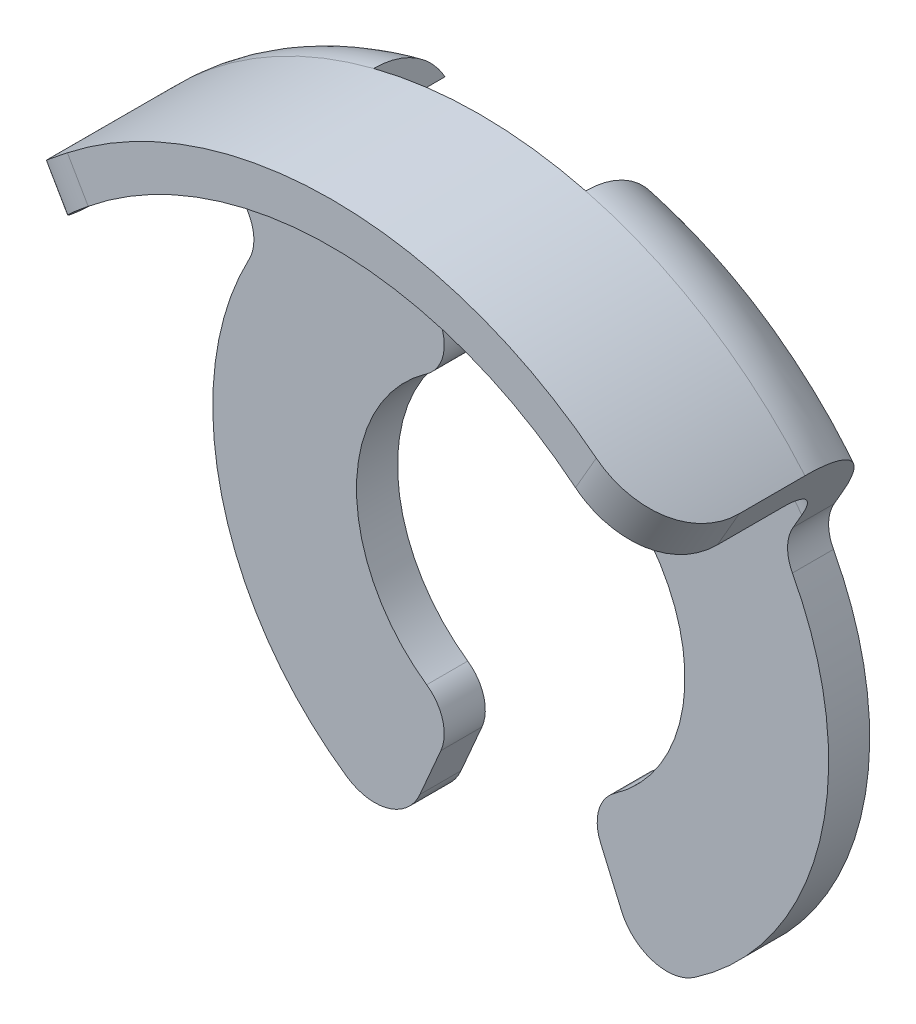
ISO-10303-21;
HEADER;
FILE_DESCRIPTION(('STEP AP214'),'2;1');
FILE_NAME('part.step','',(''),(''),'','','');
FILE_SCHEMA(('AUTOMOTIVE_DESIGN { 1 0 10303 214 1 1 1 1 }'));
ENDSEC;
DATA;
#1=APPLICATION_CONTEXT('core data for automotive mechanical design processes');
#2=APPLICATION_PROTOCOL_DEFINITION('international standard','automotive_design',2000,#1);
#3=PRODUCT_CONTEXT('',#1,'mechanical');
#4=PRODUCT('Part','Part','',(#3));
#5=PRODUCT_RELATED_PRODUCT_CATEGORY('part','',(#4));
#6=PRODUCT_DEFINITION_FORMATION('','',#4);
#7=PRODUCT_DEFINITION_CONTEXT('part definition',#1,'design');
#8=PRODUCT_DEFINITION('design','',#6,#7);
#9=PRODUCT_DEFINITION_SHAPE('','',#8);
#10=(LENGTH_UNIT() NAMED_UNIT(*) SI_UNIT(.MILLI.,.METRE.));
#11=(NAMED_UNIT(*) PLANE_ANGLE_UNIT() SI_UNIT($,.RADIAN.));
#12=(NAMED_UNIT(*) SI_UNIT($,.STERADIAN.) SOLID_ANGLE_UNIT());
#13=UNCERTAINTY_MEASURE_WITH_UNIT(LENGTH_MEASURE(1.E-05),#10,'distance_accuracy_value','');
#14=(GEOMETRIC_REPRESENTATION_CONTEXT(3) GLOBAL_UNCERTAINTY_ASSIGNED_CONTEXT((#13)) GLOBAL_UNIT_ASSIGNED_CONTEXT((#10,
#11,#12)) REPRESENTATION_CONTEXT('',''));
#15=CARTESIAN_POINT('',(0.,0.,0.));
#16=DIRECTION('',(0.,0.,1.));
#17=DIRECTION('',(1.,0.,0.));
#18=AXIS2_PLACEMENT_3D('',#15,#16,#17);
#19=CARTESIAN_POINT('',(0.,0.,-2.3));
#20=DIRECTION('',(0.,0.,1.));
#21=DIRECTION('',(1.,0.,0.));
#22=AXIS2_PLACEMENT_3D('',#19,#20,#21);
#23=CYLINDRICAL_SURFACE('',#22,4.7);
#24=CARTESIAN_POINT('',(0.,0.,-1.8));
#25=DIRECTION('',(0.,0.,1.));
#26=DIRECTION('',(1.,0.,0.));
#27=AXIS2_PLACEMENT_3D('',#24,#25,#26);
#28=CIRCLE('',#27,4.7);
#29=CARTESIAN_POINT('',(-3.69467864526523,2.90505588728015,-1.8));
#30=VERTEX_POINT('',#29);
#31=CARTESIAN_POINT('',(-1.29130739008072,4.51912881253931,-1.8));
#32=VERTEX_POINT('',#31);
#33=EDGE_CURVE('E282',#30,#32,#28,.F.);
#34=ORIENTED_EDGE('',*,*,#33,.T.);
#35=CARTESIAN_POINT('',(0.,0.,-1.8));
#36=DIRECTION('',(0.,0.,1.));
#37=DIRECTION('',(1.,0.,0.));
#38=AXIS2_PLACEMENT_3D('',#35,#36,#37);
#39=CIRCLE('',#38,4.7);
#40=CARTESIAN_POINT('',(1.29130739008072,4.51912881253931,-1.8));
#41=VERTEX_POINT('',#40);
#42=EDGE_CURVE('E268',#32,#41,#39,.F.);
#43=ORIENTED_EDGE('',*,*,#42,.T.);
#44=CARTESIAN_POINT('',(3.69467864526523,2.90505588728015,-1.8));
#45=VERTEX_POINT('',#44);
#46=EDGE_CURVE('E275',#41,#45,#39,.F.);
#47=ORIENTED_EDGE('',*,*,#46,.T.);
#48=DIRECTION('',(0.,0.,1.));
#49=VECTOR('',#48,1.);
#50=CARTESIAN_POINT('',(3.69467864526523,2.90505588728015,-2.3));
#51=LINE('',#50,#49);
#52=CARTESIAN_POINT('',(3.69467864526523,2.90505588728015,-1.));
#53=VERTEX_POINT('',#52);
#54=EDGE_CURVE('E614',#45,#53,#51,.T.);
#55=ORIENTED_EDGE('',*,*,#54,.T.);
#56=CARTESIAN_POINT('',(3.69467864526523,2.90505588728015,-1.));
#57=CARTESIAN_POINT('',(3.69467847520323,2.90505378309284,-0.973078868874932));
#58=CARTESIAN_POINT('',(3.6939544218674,2.9059771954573,-0.946171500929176));
#59=CARTESIAN_POINT('',(3.69106572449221,2.90964636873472,-0.892566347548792));
#60=CARTESIAN_POINT('',(3.68890147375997,2.91239163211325,-0.865868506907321));
#61=CARTESIAN_POINT('',(3.68028232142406,2.92328795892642,-0.786558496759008));
#62=CARTESIAN_POINT('',(3.671700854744,2.93410007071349,-0.734505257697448));
#63=CARTESIAN_POINT('',(3.64907665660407,2.96218830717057,-0.633499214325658));
#64=CARTESIAN_POINT('',(3.63503705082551,2.97946073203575,-0.584544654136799));
#65=CARTESIAN_POINT('',(3.60178158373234,3.0195771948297,-0.490831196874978));
#66=CARTESIAN_POINT('',(3.58256245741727,3.04242474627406,-0.446074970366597));
#67=CARTESIAN_POINT('',(3.53843607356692,3.09364739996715,-0.360100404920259));
#68=CARTESIAN_POINT('',(3.51333483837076,3.12220455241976,-0.319090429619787));
#69=CARTESIAN_POINT('',(3.45831701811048,3.18303694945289,-0.243558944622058));
#70=CARTESIAN_POINT('',(3.42839866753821,3.21531355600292,-0.209039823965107));
#71=CARTESIAN_POINT('',(3.36243928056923,3.28426536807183,-0.145544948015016));
#72=CARTESIAN_POINT('',(3.32615079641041,3.32108521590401,-0.116982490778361));
#73=CARTESIAN_POINT('',(3.24943681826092,3.39617966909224,-0.068746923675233));
#74=CARTESIAN_POINT('',(3.20901398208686,3.43445333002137,-0.0490681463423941));
#75=CARTESIAN_POINT('',(3.1351965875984,3.50176947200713,-0.0228853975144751));
#76=CARTESIAN_POINT('',(3.10249095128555,3.53078777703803,-0.0143391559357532));
#77=CARTESIAN_POINT('',(3.03572749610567,3.58836064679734,-0.00289130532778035));
#78=CARTESIAN_POINT('',(3.00166996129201,3.61691530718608,1.14831331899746E-05));
#79=CARTESIAN_POINT('',(2.96717361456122,3.64498021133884,0.));
#80=B_SPLINE_CURVE_WITH_KNOTS('',3,(#56,#57,#58,#59,#60,#61,#62,#63,#64,#65,#66,#67,#68,#69,#70,
#71,#72,#73,#74,#75,#76,#77,#78,#79),.UNSPECIFIED.,.F.,.F.,(4,2,2,2,2,2,2,2,2,2,2,4),(0.,
0.0807109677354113,0.161399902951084,0.322113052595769,0.482734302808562,0.643457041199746,
0.810500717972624,0.977605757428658,1.15397289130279,1.33022734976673,1.46351450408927,
1.59677379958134),.UNSPECIFIED.);
#81=CARTESIAN_POINT('',(2.96717361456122,3.64498021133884,0.));
#82=VERTEX_POINT('',#81);
#83=EDGE_CURVE('E381',#53,#82,#80,.T.);
#84=ORIENTED_EDGE('',*,*,#83,.T.);
#85=CARTESIAN_POINT('',(0.,0.,0.));
#86=DIRECTION('',(0.,0.,1.));
#87=DIRECTION('',(1.,0.,0.));
#88=AXIS2_PLACEMENT_3D('',#85,#86,#87);
#89=CIRCLE('',#88,4.7);
#90=CARTESIAN_POINT('',(-2.96717361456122,3.64498021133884,0.));
#91=VERTEX_POINT('',#90);
#92=EDGE_CURVE('E601',#82,#91,#89,.T.);
#93=ORIENTED_EDGE('',*,*,#92,.T.);
#94=CARTESIAN_POINT('',(-2.96717361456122,3.64498021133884,0.));
#95=CARTESIAN_POINT('',(-3.01222202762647,3.60835966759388,4.08302705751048E-05));
#96=CARTESIAN_POINT('',(-3.05650134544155,3.57087810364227,-0.00492477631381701));
#97=CARTESIAN_POINT('',(-3.1424009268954,3.49549373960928,-0.0243435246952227));
#98=CARTESIAN_POINT('',(-3.18402627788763,3.45759191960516,-0.0387778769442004));
#99=CARTESIAN_POINT('',(-3.26366437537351,3.38253126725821,-0.0766035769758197));
#100=CARTESIAN_POINT('',(-3.30167884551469,3.34537208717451,-0.0999906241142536));
#101=CARTESIAN_POINT('',(-3.37339732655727,3.27303845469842,-0.155029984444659));
#102=CARTESIAN_POINT('',(-3.407099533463,3.23786483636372,-0.186685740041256));
#103=CARTESIAN_POINT('',(-3.47030967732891,3.17003995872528,-0.258295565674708));
#104=CARTESIAN_POINT('',(-3.49970246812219,3.1374659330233,-0.29842476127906));
#105=CARTESIAN_POINT('',(-3.55281283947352,3.07719639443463,-0.385546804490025));
#106=CARTESIAN_POINT('',(-3.57652989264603,3.04950133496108,-0.432540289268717));
#107=CARTESIAN_POINT('',(-3.6175340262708,3.00074199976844,-0.531532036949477));
#108=CARTESIAN_POINT('',(-3.63490248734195,2.97959437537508,-0.583455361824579));
#109=CARTESIAN_POINT('',(-3.66322045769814,2.94471161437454,-0.691349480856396));
#110=CARTESIAN_POINT('',(-3.67417952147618,2.93096544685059,-0.747314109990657));
#111=CARTESIAN_POINT('',(-3.68607552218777,2.91597200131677,-0.836511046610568));
#112=CARTESIAN_POINT('',(-3.689299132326,2.91188796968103,-0.868998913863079));
#113=CARTESIAN_POINT('',(-3.69360028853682,2.90642760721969,-0.934317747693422));
#114=CARTESIAN_POINT('',(-3.69467939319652,2.90504930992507,-0.967148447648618));
#115=CARTESIAN_POINT('',(-3.69467864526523,2.90505588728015,-1.));
#116=B_SPLINE_CURVE_WITH_KNOTS('',3,(#94,#95,#96,#97,#98,#99,#100,#101,#102,#103,#104,#105,#106,
#107,#108,#109,#110,#111,#112,#113,#114,#115),.UNSPECIFIED.,.F.,.F.,(4,2,2,2,2,2,2,2,2,2,4),(0.,
0.17386588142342,0.347387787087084,0.520826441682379,0.69433741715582,0.871864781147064,
1.04940863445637,1.22458940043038,1.39950835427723,1.49804819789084,1.59651639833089),.UNSPECIFIED.);
#117=CARTESIAN_POINT('',(-3.69467864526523,2.90505588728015,-1.));
#118=VERTEX_POINT('',#117);
#119=EDGE_CURVE('E372',#91,#118,#116,.T.);
#120=ORIENTED_EDGE('',*,*,#119,.T.);
#121=DIRECTION('',(0.,0.,1.));
#122=VECTOR('',#121,1.);
#123=CARTESIAN_POINT('',(-3.69467864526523,2.90505588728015,-2.3));
#124=LINE('',#123,#122);
#125=EDGE_CURVE('E621',#118,#30,#124,.F.);
#126=ORIENTED_EDGE('',*,*,#125,.T.);
#127=EDGE_LOOP('',(#34,#43,#47,#55,#84,#93,#120,#126));
#128=FACE_BOUND('',#127,.T.);
#129=ADVANCED_FACE('F39',(#128),#23,.F.);
#130=CARTESIAN_POINT('',(-1.05947923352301,3.9607453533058,-2.8));
#131=DIRECTION('',(0.,0.,1.));
#132=DIRECTION('',(1.,0.,0.));
#133=AXIS2_PLACEMENT_3D('',#130,#131,#132);
#134=CYLINDRICAL_SURFACE('',#133,0.6);
#135=DIRECTION('',(0.,0.,1.));
#136=VECTOR('',#135,1.);
#137=CARTESIAN_POINT('',(-1.29130739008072,4.51414909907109,-2.8));
#138=LINE('',#137,#136);
#139=CARTESIAN_POINT('',(-1.29130739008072,4.51414909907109,-1.86902865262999));
#140=VERTEX_POINT('',#139);
#141=CARTESIAN_POINT('',(-1.29130739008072,4.51414909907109,-2.66877209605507));
#142=VERTEX_POINT('',#141);
#143=EDGE_CURVE('E742',#140,#142,#138,.F.);
#144=ORIENTED_EDGE('',*,*,#143,.F.);
#145=CARTESIAN_POINT('',(-1.65126100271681,3.86177900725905,-2.3));
#146=CARTESIAN_POINT('',(-1.65560110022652,3.88750490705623,-2.30002128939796));
#147=CARTESIAN_POINT('',(-1.65817536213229,3.91342366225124,-2.29807440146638));
#148=CARTESIAN_POINT('',(-1.65999887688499,3.96468714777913,-2.29085514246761));
#149=CARTESIAN_POINT('',(-1.65927814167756,3.99003495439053,-2.28561316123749));
#150=CARTESIAN_POINT('',(-1.65479910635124,4.03958099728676,-2.27242302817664));
#151=CARTESIAN_POINT('',(-1.65105424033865,4.06378381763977,-2.26448693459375));
#152=CARTESIAN_POINT('',(-1.64090447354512,4.11082824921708,-2.24644193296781));
#153=CARTESIAN_POINT('',(-1.6344926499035,4.13366613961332,-2.23632740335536));
#154=CARTESIAN_POINT('',(-1.61569129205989,4.1883950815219,-2.20907693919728));
#155=CARTESIAN_POINT('',(-1.60191087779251,4.21930012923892,-2.19091582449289));
#156=CARTESIAN_POINT('',(-1.57032244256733,4.2771793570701,-2.15202552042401));
#157=CARTESIAN_POINT('',(-1.55250685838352,4.30414599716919,-2.13129154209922));
#158=CARTESIAN_POINT('',(-1.50763654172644,4.36183621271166,-2.0813450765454));
#159=CARTESIAN_POINT('',(-1.47943189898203,4.39111767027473,-2.05150195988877));
#160=CARTESIAN_POINT('',(-1.4189683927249,4.44277121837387,-1.99007995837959));
#161=CARTESIAN_POINT('',(-1.38670939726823,4.46514308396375,-1.95850101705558));
#162=CARTESIAN_POINT('',(-1.33157362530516,4.4960641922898,-1.90620057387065));
#163=CARTESIAN_POINT('',(-1.30958007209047,4.50667641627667,-1.88573184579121));
#164=CARTESIAN_POINT('',(-1.26463876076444,4.52510164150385,-1.84464022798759));
#165=CARTESIAN_POINT('',(-1.24169261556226,4.53291917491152,-1.82401764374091));
#166=CARTESIAN_POINT('',(-1.21709433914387,4.53967475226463,-1.80226870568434));
#167=CARTESIAN_POINT('',(-1.21581020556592,4.54002283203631,-1.80113433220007));
#168=CARTESIAN_POINT('',(-1.21452497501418,4.54036662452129,-1.8));
#169=B_SPLINE_CURVE_WITH_KNOTS('',3,(#145,#146,#147,#148,#149,#150,#151,#152,#153,#154,#155,
#156,#157,#158,#159,#160,#161,#162,#163,#164,#165,#166,#167,#168),.UNSPECIFIED.,.F.,.F.,(4,2,2,
2,2,2,2,2,2,2,2,4),(0.,0.077986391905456,0.155263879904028,0.232199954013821,0.309336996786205,
0.423913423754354,0.538706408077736,0.68922014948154,0.839738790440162,0.935211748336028,
1.03052916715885,1.03577439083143),.UNSPECIFIED.);
#170=CARTESIAN_POINT('',(-1.65126100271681,3.86177900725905,-2.3));
#171=VERTEX_POINT('',#170);
#172=EDGE_CURVE('E463',#140,#171,#169,.F.);
#173=ORIENTED_EDGE('',*,*,#172,.T.);
#174=CARTESIAN_POINT('',(-1.05947923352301,3.9607453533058,-2.3));
#175=DIRECTION('',(0.,0.,1.));
#176=DIRECTION('',(-1.,0.,0.));
#177=AXIS2_PLACEMENT_3D('',#174,#175,#176);
#178=CIRCLE('',#177,0.6);
#179=CARTESIAN_POINT('',(-1.61017076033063,3.72254618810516,-2.3));
#180=VERTEX_POINT('',#179);
#181=EDGE_CURVE('E547',#171,#180,#178,.T.);
#182=ORIENTED_EDGE('',*,*,#181,.T.);
#183=DIRECTION('',(0.,0.,1.));
#184=VECTOR('',#183,1.);
#185=CARTESIAN_POINT('',(-1.61017076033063,3.72254618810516,-2.8));
#186=LINE('',#185,#184);
#187=CARTESIAN_POINT('',(-1.61017076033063,3.72254618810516,-2.8));
#188=VERTEX_POINT('',#187);
#189=EDGE_CURVE('E552',#188,#180,#186,.T.);
#190=ORIENTED_EDGE('',*,*,#189,.F.);
#191=CARTESIAN_POINT('',(-1.05947923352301,3.9607453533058,-2.8));
#192=DIRECTION('',(0.,0.,1.));
#193=DIRECTION('',(-1.,0.,0.));
#194=AXIS2_PLACEMENT_3D('',#191,#192,#193);
#195=CIRCLE('',#194,0.6);
#196=CARTESIAN_POINT('',(-1.65126100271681,3.86177900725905,-2.8));
#197=VERTEX_POINT('',#196);
#198=EDGE_CURVE('E522',#197,#188,#195,.T.);
#199=ORIENTED_EDGE('',*,*,#198,.F.);
#200=CARTESIAN_POINT('',(-1.65126100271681,3.86177900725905,-2.8));
#201=CARTESIAN_POINT('',(-1.65655302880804,3.8932178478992,-2.80002912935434));
#202=CARTESIAN_POINT('',(-1.65926373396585,3.92501983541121,-2.79856098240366));
#203=CARTESIAN_POINT('',(-1.65966698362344,3.98830143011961,-2.79321929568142));
#204=CARTESIAN_POINT('',(-1.65738479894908,4.01978185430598,-2.78935793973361));
#205=CARTESIAN_POINT('',(-1.64800665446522,4.08164427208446,-2.77981732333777));
#206=CARTESIAN_POINT('',(-1.64092046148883,4.11202836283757,-2.77414176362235));
#207=CARTESIAN_POINT('',(-1.62223169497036,4.17115392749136,-2.76163321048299));
#208=CARTESIAN_POINT('',(-1.61062325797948,4.19989321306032,-2.75479872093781));
#209=CARTESIAN_POINT('',(-1.58219317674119,4.25716647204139,-2.74014291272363));
#210=CARTESIAN_POINT('',(-1.56505415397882,4.28553395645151,-2.73228597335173));
#211=CARTESIAN_POINT('',(-1.52629194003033,4.33913688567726,-2.71688380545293));
#212=CARTESIAN_POINT('',(-1.5046667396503,4.36437091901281,-2.7093387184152));
#213=CARTESIAN_POINT('',(-1.45628838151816,4.41213080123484,-2.69511788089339));
#214=CARTESIAN_POINT('',(-1.42934956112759,4.43448571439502,-2.688495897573));
#215=CARTESIAN_POINT('',(-1.37169813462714,4.47430145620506,-2.67749895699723));
#216=CARTESIAN_POINT('',(-1.34099396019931,4.49177294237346,-2.67311908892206));
#217=CARTESIAN_POINT('',(-1.29372090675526,4.51338585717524,-2.66883228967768));
#218=CARTESIAN_POINT('',(-1.27821647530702,4.51970370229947,-2.66778443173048));
#219=CARTESIAN_POINT('',(-1.2467137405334,4.53102875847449,-2.66637967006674));
#220=CARTESIAN_POINT('',(-1.23071565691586,4.53603654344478,-2.66602246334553));
#221=CARTESIAN_POINT('',(-1.21452497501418,4.54036662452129,-2.66602540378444));
#222=B_SPLINE_CURVE_WITH_KNOTS('',3,(#200,#201,#202,#203,#204,#205,#206,#207,#208,#209,#210,
#211,#212,#213,#214,#215,#216,#217,#218,#219,#220,#221),.UNSPECIFIED.,.F.,.F.,(4,2,2,2,2,2,2,2,
2,2,4),(0.,0.0954043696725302,0.190326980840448,0.285057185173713,0.379910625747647,
0.481652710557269,0.583440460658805,0.689767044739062,0.795859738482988,0.846121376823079,
0.896360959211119),.UNSPECIFIED.);
#223=EDGE_CURVE('E382',#197,#142,#222,.T.);
#224=ORIENTED_EDGE('',*,*,#223,.T.);
#225=EDGE_LOOP('',(#144,#173,#182,#190,#199,#224));
#226=FACE_BOUND('',#225,.T.);
#227=ADVANCED_FACE('F397',(#226),#134,.F.);
#228=CARTESIAN_POINT('',(1.05947923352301,3.9607453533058,-2.8));
#229=DIRECTION('',(0.,0.,1.));
#230=DIRECTION('',(1.,0.,0.));
#231=AXIS2_PLACEMENT_3D('',#228,#229,#230);
#232=CYLINDRICAL_SURFACE('',#231,0.599999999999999);
#233=DIRECTION('',(0.,0.,1.));
#234=VECTOR('',#233,1.);
#235=CARTESIAN_POINT('',(1.29130739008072,4.51414909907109,-2.8));
#236=LINE('',#235,#234);
#237=CARTESIAN_POINT('',(1.29130739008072,4.51414909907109,-2.66877209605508));
#238=VERTEX_POINT('',#237);
#239=CARTESIAN_POINT('',(1.29130739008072,4.51414909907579,-1.8690286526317));
#240=VERTEX_POINT('',#239);
#241=EDGE_CURVE('E260',#238,#240,#236,.T.);
#242=ORIENTED_EDGE('',*,*,#241,.F.);
#243=CARTESIAN_POINT('',(1.21452497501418,4.54036662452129,-2.66602540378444));
#244=CARTESIAN_POINT('',(1.24536879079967,4.5321530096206,-2.66596991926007));
#245=CARTESIAN_POINT('',(1.27548654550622,4.52142623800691,-2.66730723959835));
#246=CARTESIAN_POINT('',(1.33335880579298,4.49551459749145,-2.67231947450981));
#247=CARTESIAN_POINT('',(1.36112427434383,4.48035206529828,-2.67598278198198));
#248=CARTESIAN_POINT('',(1.41366267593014,4.44607097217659,-2.68520029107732));
#249=CARTESIAN_POINT('',(1.43843995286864,4.42695826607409,-2.6907517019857));
#250=CARTESIAN_POINT('',(1.48459600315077,4.38529581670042,-2.70308448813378));
#251=CARTESIAN_POINT('',(1.50597061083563,4.36274192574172,-2.70986734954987));
#252=CARTESIAN_POINT('',(1.54621064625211,4.31313555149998,-2.72442599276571));
#253=CARTESIAN_POINT('',(1.56481873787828,4.28588480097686,-2.73223773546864));
#254=CARTESIAN_POINT('',(1.59736230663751,4.22863765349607,-2.74761395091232));
#255=CARTESIAN_POINT('',(1.61129516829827,4.19863973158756,-2.75517828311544));
#256=CARTESIAN_POINT('',(1.63467698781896,4.13497097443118,-2.76957039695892));
#257=CARTESIAN_POINT('',(1.64386677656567,4.10119147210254,-2.77634240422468));
#258=CARTESIAN_POINT('',(1.65622906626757,4.03222970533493,-2.78772254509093));
#259=CARTESIAN_POINT('',(1.65941557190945,3.99705090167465,-2.79233569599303));
#260=CARTESIAN_POINT('',(1.6595080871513,3.94506515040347,-2.79692433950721));
#261=CARTESIAN_POINT('',(1.65883727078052,3.92833578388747,-2.79806279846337));
#262=CARTESIAN_POINT('',(1.65609706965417,3.89496271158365,-2.79960130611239));
#263=CARTESIAN_POINT('',(1.65402804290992,3.8783189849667,-2.80000154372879));
#264=CARTESIAN_POINT('',(1.65126100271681,3.86177900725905,-2.8));
#265=B_SPLINE_CURVE_WITH_KNOTS('',3,(#243,#244,#245,#246,#247,#248,#249,#250,#251,#252,#253,
#254,#255,#256,#257,#258,#259,#260,#261,#262,#263,#264),.UNSPECIFIED.,.F.,.F.,(4,2,2,2,2,2,2,2,
2,2,4),(0.,0.0955422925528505,0.190611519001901,0.285540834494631,0.38058548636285,
0.481878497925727,0.583228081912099,0.689647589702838,0.795818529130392,0.846097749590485,
0.896364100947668),.UNSPECIFIED.);
#266=CARTESIAN_POINT('',(1.65126100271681,3.86177900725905,-2.8));
#267=VERTEX_POINT('',#266);
#268=EDGE_CURVE('E723',#238,#267,#265,.T.);
#269=ORIENTED_EDGE('',*,*,#268,.T.);
#270=CARTESIAN_POINT('',(1.05947923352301,3.9607453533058,-2.8));
#271=DIRECTION('',(0.,0.,1.));
#272=DIRECTION('',(-1.,0.,0.));
#273=AXIS2_PLACEMENT_3D('',#270,#271,#272);
#274=CIRCLE('',#273,0.599999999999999);
#275=CARTESIAN_POINT('',(1.61017076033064,3.72254618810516,-2.8));
#276=VERTEX_POINT('',#275);
#277=EDGE_CURVE('E518',#276,#267,#274,.T.);
#278=ORIENTED_EDGE('',*,*,#277,.F.);
#279=DIRECTION('',(0.,0.,1.));
#280=VECTOR('',#279,1.);
#281=CARTESIAN_POINT('',(1.61017076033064,3.72254618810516,-2.8));
#282=LINE('',#281,#280);
#283=CARTESIAN_POINT('',(1.61017076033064,3.72254618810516,-2.3));
#284=VERTEX_POINT('',#283);
#285=EDGE_CURVE('E557',#276,#284,#282,.T.);
#286=ORIENTED_EDGE('',*,*,#285,.T.);
#287=CARTESIAN_POINT('',(1.05947923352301,3.9607453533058,-2.3));
#288=DIRECTION('',(0.,0.,1.));
#289=DIRECTION('',(-1.,0.,0.));
#290=AXIS2_PLACEMENT_3D('',#287,#288,#289);
#291=CIRCLE('',#290,0.599999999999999);
#292=CARTESIAN_POINT('',(1.65126100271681,3.86177900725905,-2.3));
#293=VERTEX_POINT('',#292);
#294=EDGE_CURVE('E543',#284,#293,#291,.T.);
#295=ORIENTED_EDGE('',*,*,#294,.T.);
#296=CARTESIAN_POINT('',(1.65126100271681,3.86177900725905,-2.3));
#297=CARTESIAN_POINT('',(1.65560110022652,3.88750490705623,-2.30002128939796));
#298=CARTESIAN_POINT('',(1.65817536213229,3.91342366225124,-2.29807440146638));
#299=CARTESIAN_POINT('',(1.65999887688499,3.96468714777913,-2.29085514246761));
#300=CARTESIAN_POINT('',(1.65927814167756,3.99003495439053,-2.28561316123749));
#301=CARTESIAN_POINT('',(1.65479910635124,4.03958099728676,-2.27242302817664));
#302=CARTESIAN_POINT('',(1.65105424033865,4.06378381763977,-2.26448693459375));
#303=CARTESIAN_POINT('',(1.64090447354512,4.11082824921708,-2.24644193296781));
#304=CARTESIAN_POINT('',(1.6344926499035,4.13366613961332,-2.23632740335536));
#305=CARTESIAN_POINT('',(1.61569129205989,4.1883950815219,-2.20907693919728));
#306=CARTESIAN_POINT('',(1.60191087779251,4.21930012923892,-2.19091582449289));
#307=CARTESIAN_POINT('',(1.57032244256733,4.2771793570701,-2.15202552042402));
#308=CARTESIAN_POINT('',(1.55250685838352,4.30414599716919,-2.13129154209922));
#309=CARTESIAN_POINT('',(1.50763654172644,4.36183621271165,-2.0813450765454));
#310=CARTESIAN_POINT('',(1.47943189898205,4.39111767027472,-2.05150195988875));
#311=CARTESIAN_POINT('',(1.41896839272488,4.44277121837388,-1.99007995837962));
#312=CARTESIAN_POINT('',(1.38670939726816,4.46514308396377,-1.95850101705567));
#313=CARTESIAN_POINT('',(1.33157362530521,4.49606419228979,-1.9062005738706));
#314=CARTESIAN_POINT('',(1.30958007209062,4.50667641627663,-1.88573184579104));
#315=CARTESIAN_POINT('',(1.2646387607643,4.52510164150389,-1.84464022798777));
#316=CARTESIAN_POINT('',(1.24169261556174,4.53291917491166,-1.82401764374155));
#317=CARTESIAN_POINT('',(1.21709433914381,4.53967475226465,-1.80226870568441));
#318=CARTESIAN_POINT('',(1.2158102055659,4.54002283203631,-1.80113433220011));
#319=CARTESIAN_POINT('',(1.21452497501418,4.54036662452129,-1.8));
#320=B_SPLINE_CURVE_WITH_KNOTS('',3,(#296,#297,#298,#299,#300,#301,#302,#303,#304,#305,#306,
#307,#308,#309,#310,#311,#312,#313,#314,#315,#316,#317,#318,#319),.UNSPECIFIED.,.F.,.F.,(4,2,2,
2,2,2,2,2,2,2,2,4),(0.,0.0779863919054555,0.155263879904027,0.23219995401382,0.309336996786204,
0.423913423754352,0.538706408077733,0.689220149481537,0.839738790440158,0.935211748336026,
1.03052916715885,1.03577439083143),.UNSPECIFIED.);
#321=EDGE_CURVE('E305',#293,#240,#320,.T.);
#322=ORIENTED_EDGE('',*,*,#321,.T.);
#323=EDGE_LOOP('',(#242,#269,#278,#286,#295,#322));
#324=FACE_BOUND('',#323,.T.);
#325=ADVANCED_FACE('F319',(#324),#232,.F.);
#326=CARTESIAN_POINT('',(0.,0.,-1.8));
#327=DIRECTION('',(0.,0.,1.));
#328=DIRECTION('',(1.,0.,0.));
#329=AXIS2_PLACEMENT_3D('',#326,#327,#328);
#330=TOROIDAL_SURFACE('',#329,4.2,1.);
#331=ORIENTED_EDGE('',*,*,#268,.F.);
#332=CARTESIAN_POINT('',(1.29130739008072,3.27573902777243,-2.53420392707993));
#333=CARTESIAN_POINT('',(1.29130739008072,3.32257350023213,-2.57449179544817));
#334=CARTESIAN_POINT('',(1.29130739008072,3.3729599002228,-2.61074406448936));
#335=CARTESIAN_POINT('',(1.29130739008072,3.4791709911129,-2.67430043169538));
#336=CARTESIAN_POINT('',(1.29130739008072,3.53500619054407,-2.70158677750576));
#337=CARTESIAN_POINT('',(1.29130739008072,3.65033823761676,-2.74648272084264));
#338=CARTESIAN_POINT('',(1.29130739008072,3.70982885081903,-2.764108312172));
#339=CARTESIAN_POINT('',(1.29130739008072,3.83087826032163,-2.78927519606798));
#340=CARTESIAN_POINT('',(1.29130739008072,3.89243616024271,-2.79682080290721));
#341=CARTESIAN_POINT('',(1.29130739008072,4.01683577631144,-2.80158852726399));
#342=CARTESIAN_POINT('',(1.29130739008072,4.07968331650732,-2.79866267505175));
#343=CARTESIAN_POINT('',(1.29130739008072,4.20395909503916,-2.78207587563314));
#344=CARTESIAN_POINT('',(1.29130739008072,4.26538729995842,-2.76841467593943));
#345=CARTESIAN_POINT('',(1.29130739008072,4.38369043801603,-2.73095010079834));
#346=CARTESIAN_POINT('',(1.29130739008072,4.44063292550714,-2.70736052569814));
#347=CARTESIAN_POINT('',(1.29130739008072,4.54951632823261,-2.65058045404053));
#348=CARTESIAN_POINT('',(1.29130739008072,4.60145835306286,-2.61739209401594));
#349=CARTESIAN_POINT('',(1.29130739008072,4.69669836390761,-2.54372978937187));
#350=CARTESIAN_POINT('',(1.29130739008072,4.74025348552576,-2.50358836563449));
#351=CARTESIAN_POINT('',(1.29130739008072,4.81966974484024,-2.41630201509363));
#352=CARTESIAN_POINT('',(1.29130739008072,4.85553267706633,-2.36915872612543));
#353=CARTESIAN_POINT('',(1.29130739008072,4.91709712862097,-2.27118437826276));
#354=CARTESIAN_POINT('',(1.29130739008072,4.94313790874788,-2.22056636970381));
#355=CARTESIAN_POINT('',(1.29130739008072,4.98607556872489,-2.11559014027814));
#356=CARTESIAN_POINT('',(1.29130739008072,5.00297404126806,-2.0612325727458));
#357=CARTESIAN_POINT('',(1.29130739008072,5.02671336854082,-1.95193224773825));
#358=CARTESIAN_POINT('',(1.29130739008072,5.03381786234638,-1.89704662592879));
#359=CARTESIAN_POINT('',(1.29130739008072,5.0385935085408,-1.78686844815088));
#360=CARTESIAN_POINT('',(1.29130739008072,5.03626551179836,-1.73157592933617));
#361=CARTESIAN_POINT('',(1.29130739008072,5.0223362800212,-1.62282022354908));
#362=CARTESIAN_POINT('',(1.29130739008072,5.01084159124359,-1.56934333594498));
#363=CARTESIAN_POINT('',(1.29130739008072,4.97908562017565,-1.46506276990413));
#364=CARTESIAN_POINT('',(1.29130739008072,4.95882434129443,-1.41425909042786));
#365=CARTESIAN_POINT('',(1.29130739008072,4.9100394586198,-1.31643198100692));
#366=CARTESIAN_POINT('',(1.29130739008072,4.88146971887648,-1.26943158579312));
#367=CARTESIAN_POINT('',(1.29130739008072,4.81700094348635,-1.18076534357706));
#368=CARTESIAN_POINT('',(1.29130739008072,4.78110132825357,-1.13909991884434));
#369=CARTESIAN_POINT('',(1.29130739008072,4.70219905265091,-1.06129860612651));
#370=CARTESIAN_POINT('',(1.29130739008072,4.65906024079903,-1.02530090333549));
#371=CARTESIAN_POINT('',(1.29130739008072,4.56751944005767,-0.960780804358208));
#372=CARTESIAN_POINT('',(1.29130739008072,4.51911669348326,-0.932259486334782));
#373=CARTESIAN_POINT('',(1.29130739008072,4.41668738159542,-0.882455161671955));
#374=CARTESIAN_POINT('',(1.29130739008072,4.36252596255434,-0.861449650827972));
#375=CARTESIAN_POINT('',(1.29130739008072,4.2515280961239,-0.8284462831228));
#376=CARTESIAN_POINT('',(1.29130739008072,4.19469114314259,-0.816450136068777));
#377=CARTESIAN_POINT('',(1.29130739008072,4.07757384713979,-0.801322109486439));
#378=CARTESIAN_POINT('',(1.29130739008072,4.01724601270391,-0.798557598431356));
#379=CARTESIAN_POINT('',(1.29130739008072,3.89693957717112,-0.802852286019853));
#380=CARTESIAN_POINT('',(1.29130739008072,3.83696104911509,-0.809913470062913));
#381=CARTESIAN_POINT('',(1.29130739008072,3.71699381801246,-0.833989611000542));
#382=CARTESIAN_POINT('',(1.29130739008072,3.65706851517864,-0.851321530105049));
#383=CARTESIAN_POINT('',(1.29130739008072,3.54092997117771,-0.895726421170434));
#384=CARTESIAN_POINT('',(1.29130739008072,3.48471730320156,-0.922800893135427));
#385=CARTESIAN_POINT('',(1.29130739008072,3.37731471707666,-0.986266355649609));
#386=CARTESIAN_POINT('',(1.29130739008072,3.3261595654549,-1.02271636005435));
#387=CARTESIAN_POINT('',(1.29130739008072,3.23099581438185,-1.104008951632));
#388=CARTESIAN_POINT('',(1.29130739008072,3.18698624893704,-1.14885040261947));
#389=CARTESIAN_POINT('',(1.29130739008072,3.10939798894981,-1.24389498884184));
#390=CARTESIAN_POINT('',(1.29130739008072,3.07547730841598,-1.29381812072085));
#391=CARTESIAN_POINT('',(1.29130739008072,3.017329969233,-1.39902456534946));
#392=CARTESIAN_POINT('',(1.29130739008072,2.99309722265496,-1.45430448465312));
#393=CARTESIAN_POINT('',(1.29130739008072,2.95703815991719,-1.56402498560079));
#394=CARTESIAN_POINT('',(1.29130739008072,2.9443940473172,-1.61819693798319));
#395=CARTESIAN_POINT('',(1.29130739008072,2.92905953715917,-1.72792274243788));
#396=CARTESIAN_POINT('',(1.29130739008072,2.92636413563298,-1.78347588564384));
#397=CARTESIAN_POINT('',(1.29130739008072,2.93091101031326,-1.89068646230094));
#398=CARTESIAN_POINT('',(1.29130739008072,2.93754454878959,-1.94237095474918));
#399=CARTESIAN_POINT('',(1.29130739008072,2.95936475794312,-2.04391035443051));
#400=CARTESIAN_POINT('',(1.29130739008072,2.97455379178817,-2.09376475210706));
#401=CARTESIAN_POINT('',(1.29130739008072,3.01292993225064,-2.19057966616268));
#402=CARTESIAN_POINT('',(1.29130739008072,3.0361593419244,-2.23752329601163));
#403=CARTESIAN_POINT('',(1.29130739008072,3.08970042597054,-2.32711981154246));
#404=CARTESIAN_POINT('',(1.29130739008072,3.12000515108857,-2.36977684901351));
#405=CARTESIAN_POINT('',(1.29130739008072,3.17195673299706,-2.43225565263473));
#406=CARTESIAN_POINT('',(1.29130739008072,3.19152128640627,-2.45384628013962));
#407=CARTESIAN_POINT('',(1.29130739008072,3.23237388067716,-2.49532476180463));
#408=CARTESIAN_POINT('',(1.29130739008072,3.2536618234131,-2.51521271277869));
#409=CARTESIAN_POINT('',(1.29130739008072,3.27573902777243,-2.53420392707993));
#410=B_SPLINE_CURVE_WITH_KNOTS('',3,(#332,#333,#334,#335,#336,#337,#338,#339,#340,#341,#342,
#343,#344,#345,#346,#347,#348,#349,#350,#351,#352,#353,#354,#355,#356,#357,#358,#359,#360,#361,
#362,#363,#364,#365,#366,#367,#368,#369,#370,#371,#372,#373,#374,#375,#376,#377,#378,#379,#380,
#381,#382,#383,#384,#385,#386,#387,#388,#389,#390,#391,#392,#393,#394,#395,#396,#397,#398,#399,
#400,#401,#402,#403,#404,#405,#406,#407,#408,#409),.UNSPECIFIED.,.T.,.F.,(4,2,2,2,2,2,2,2,2,2,2,
2,2,2,2,2,2,2,2,2,2,2,2,2,2,2,2,2,2,2,2,2,2,2,2,2,2,2,4),(0.,0.185225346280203,
0.370815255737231,0.556096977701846,0.741299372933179,0.929129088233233,1.11696322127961,
1.30094421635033,1.48488429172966,1.6616897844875,1.83845398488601,2.00838397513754,
2.17828435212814,2.34351555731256,2.50873185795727,2.67205532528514,2.83537872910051,
2.99962695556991,3.16388817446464,3.33168191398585,3.49949983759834,3.67299471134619,
3.84652250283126,4.02687833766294,4.20727062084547,4.39354319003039,4.57984445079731,
4.76734836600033,4.95482691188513,5.1349368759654,5.31493347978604,5.48094191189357,
5.64686683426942,5.80245321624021,5.95808259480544,6.11454356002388,6.27085149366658,
6.35816945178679,6.44548244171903),.UNSPECIFIED.);
#411=CARTESIAN_POINT('',(1.29130739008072,5.03711477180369,-1.8));
#412=VERTEX_POINT('',#411);
#413=EDGE_CURVE('E490',#238,#412,#410,.T.);
#414=ORIENTED_EDGE('',*,*,#413,.T.);
#415=CARTESIAN_POINT('',(0.,0.,-1.8));
#416=DIRECTION('',(0.,0.,1.));
#417=DIRECTION('',(1.,0.,0.));
#418=AXIS2_PLACEMENT_3D('',#415,#416,#417);
#419=CIRCLE('',#418,5.2);
#420=CARTESIAN_POINT('',(3.96193160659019,3.36795159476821,-1.8));
#421=VERTEX_POINT('',#420);
#422=EDGE_CURVE('E428',#421,#412,#419,.T.);
#423=ORIENTED_EDGE('',*,*,#422,.F.);
#424=CARTESIAN_POINT('',(3.42275826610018,2.43407597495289,-2.8));
#425=CARTESIAN_POINT('',(3.45518916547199,2.49024794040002,-2.80004277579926));
#426=CARTESIAN_POINT('',(3.48764834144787,2.54646888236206,-2.7947817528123));
#427=CARTESIAN_POINT('',(3.55177541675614,2.65754023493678,-2.77361237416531));
#428=CARTESIAN_POINT('',(3.58344085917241,2.7123863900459,-2.75767439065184));
#429=CARTESIAN_POINT('',(3.64501230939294,2.81903127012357,-2.71506186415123));
#430=CARTESIAN_POINT('',(3.67491409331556,2.87082267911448,-2.68836265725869));
#431=CARTESIAN_POINT('',(3.73180196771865,2.96935536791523,-2.62467084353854));
#432=CARTESIAN_POINT('',(3.75879216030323,3.01610375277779,-2.58769298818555));
#433=CARTESIAN_POINT('',(3.80726666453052,3.10006405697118,-2.50692006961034));
#434=CARTESIAN_POINT('',(3.82899068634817,3.13769116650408,-2.46370105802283));
#435=CARTESIAN_POINT('',(3.86816695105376,3.20554644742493,-2.37006275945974));
#436=CARTESIAN_POINT('',(3.88561886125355,3.23577404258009,-2.31964291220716));
#437=CARTESIAN_POINT('',(3.91443541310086,3.28568577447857,-2.21700675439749));
#438=CARTESIAN_POINT('',(3.92614685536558,3.30597058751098,-2.16517860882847));
#439=CARTESIAN_POINT('',(3.94478781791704,3.33825768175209,-2.0582299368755));
#440=CARTESIAN_POINT('',(3.95172495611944,3.35027315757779,-2.00311480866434));
#441=CARTESIAN_POINT('',(3.95807018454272,3.36126341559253,-1.92290082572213));
#442=CARTESIAN_POINT('',(3.95951811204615,3.36377129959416,-1.89839042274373));
#443=CARTESIAN_POINT('',(3.96144786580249,3.36711373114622,-1.8492575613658));
#444=CARTESIAN_POINT('',(3.96193123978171,3.36795095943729,-1.82463534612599));
#445=CARTESIAN_POINT('',(3.96193160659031,3.36795159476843,-1.80000000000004));
#446=B_SPLINE_CURVE_WITH_KNOTS('',3,(#424,#425,#426,#427,#428,#429,#430,#431,#432,#433,#434,
#435,#436,#437,#438,#439,#440,#441,#442,#443,#444,#445),.UNSPECIFIED.,.F.,.F.,(4,2,2,2,2,2,2,2,
2,2,4),(0.,0.194459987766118,0.389461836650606,0.58491317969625,0.78008545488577,
0.962965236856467,1.14585925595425,1.31563661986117,1.48514245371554,1.55912229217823,
1.63298332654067),.UNSPECIFIED.);
#447=CARTESIAN_POINT('',(3.42275826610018,2.43407597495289,-2.8));
#448=VERTEX_POINT('',#447);
#449=EDGE_CURVE('E776',#448,#421,#446,.T.);
#450=ORIENTED_EDGE('',*,*,#449,.F.);
#451=CARTESIAN_POINT('',(0.,0.,-2.8));
#452=DIRECTION('',(0.,0.,1.));
#453=DIRECTION('',(1.,0.,0.));
#454=AXIS2_PLACEMENT_3D('',#451,#452,#453);
#455=CIRCLE('',#454,4.2);
#456=EDGE_CURVE('E445',#267,#448,#455,.F.);
#457=ORIENTED_EDGE('',*,*,#456,.F.);
#458=EDGE_LOOP('',(#331,#414,#423,#450,#457));
#459=FACE_BOUND('',#458,.T.);
#460=ADVANCED_FACE('F418',(#459),#330,.T.);
#461=CARTESIAN_POINT('',(-1.29130739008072,5.03711477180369,-1.8));
#462=VERTEX_POINT('',#461);
#463=CARTESIAN_POINT('',(-3.96193160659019,3.36795159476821,-1.8));
#464=VERTEX_POINT('',#463);
#465=EDGE_CURVE('E427',#462,#464,#419,.T.);
#466=ORIENTED_EDGE('',*,*,#465,.F.);
#467=CARTESIAN_POINT('',(-1.29130739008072,3.27573902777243,-2.53420392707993));
#468=CARTESIAN_POINT('',(-1.29130739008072,3.23287851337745,-2.49733012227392));
#469=CARTESIAN_POINT('',(-1.29130739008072,3.19293319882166,-2.457028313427));
#470=CARTESIAN_POINT('',(-1.29130739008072,3.12016635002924,-2.37038643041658));
#471=CARTESIAN_POINT('',(-1.29130739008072,3.08734876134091,-2.32404303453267));
#472=CARTESIAN_POINT('',(-1.29130739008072,3.03002309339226,-2.22625826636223));
#473=CARTESIAN_POINT('',(-1.29130739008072,3.00554018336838,-2.17480204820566));
#474=CARTESIAN_POINT('',(-1.29130739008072,2.9661561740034,-2.06834898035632));
#475=CARTESIAN_POINT('',(-1.29130739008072,2.95125010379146,-2.01335398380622));
#476=CARTESIAN_POINT('',(-1.29130739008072,2.93231866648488,-1.90464416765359));
#477=CARTESIAN_POINT('',(-1.29130739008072,2.92773921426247,-1.85102567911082));
#478=CARTESIAN_POINT('',(-1.29130739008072,2.92804304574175,-1.74382114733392));
#479=CARTESIAN_POINT('',(-1.29130739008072,2.93292445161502,-1.69023509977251));
#480=CARTESIAN_POINT('',(-1.29130739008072,2.95153769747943,-1.58673695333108));
#481=CARTESIAN_POINT('',(-1.29130739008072,2.96492732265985,-1.53676257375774));
#482=CARTESIAN_POINT('',(-1.29130739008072,2.99964766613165,-1.43966192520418));
#483=CARTESIAN_POINT('',(-1.29130739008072,3.02097929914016,-1.39253598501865));
#484=CARTESIAN_POINT('',(-1.29130739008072,3.07157501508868,-1.30076298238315));
#485=CARTESIAN_POINT('',(-1.29130739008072,3.10107359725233,-1.25624560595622));
#486=CARTESIAN_POINT('',(-1.29130739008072,3.16663866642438,-1.17235110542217));
#487=CARTESIAN_POINT('',(-1.29130739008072,3.20270712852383,-1.13297553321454));
#488=CARTESIAN_POINT('',(-1.29130739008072,3.28323362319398,-1.05739478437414));
#489=CARTESIAN_POINT('',(-1.29130739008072,3.3281153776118,-1.02164103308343));
#490=CARTESIAN_POINT('',(-1.29130739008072,3.42292858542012,-0.95761132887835));
#491=CARTESIAN_POINT('',(-1.29130739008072,3.47286169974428,-0.929337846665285));
#492=CARTESIAN_POINT('',(-1.29130739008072,3.57994124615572,-0.879206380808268));
#493=CARTESIAN_POINT('',(-1.29130739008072,3.63734653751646,-0.85789988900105));
#494=CARTESIAN_POINT('',(-1.29130739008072,3.75486840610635,-0.824934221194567));
#495=CARTESIAN_POINT('',(-1.29130739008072,3.8149854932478,-0.813276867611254));
#496=CARTESIAN_POINT('',(-1.29130739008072,3.93796584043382,-0.79978513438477));
#497=CARTESIAN_POINT('',(-1.29130739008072,4.00085943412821,-0.798224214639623));
#498=CARTESIAN_POINT('',(-1.29130739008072,4.12600096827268,-0.80583463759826));
#499=CARTESIAN_POINT('',(-1.29130739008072,4.18824892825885,-0.815005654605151));
#500=CARTESIAN_POINT('',(-1.29130739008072,4.30937361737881,-0.843798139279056));
#501=CARTESIAN_POINT('',(-1.29130739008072,4.3682851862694,-0.863272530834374));
#502=CARTESIAN_POINT('',(-1.29130739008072,4.48180987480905,-0.912207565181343));
#503=CARTESIAN_POINT('',(-1.29130739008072,4.53642382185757,-0.941666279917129));
#504=CARTESIAN_POINT('',(-1.29130739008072,4.63763775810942,-1.00859629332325));
#505=CARTESIAN_POINT('',(-1.29130739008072,4.68445823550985,-1.04573401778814));
#506=CARTESIAN_POINT('',(-1.29130739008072,4.77087092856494,-1.12763988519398));
#507=CARTESIAN_POINT('',(-1.29130739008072,4.81046484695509,-1.17240622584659));
#508=CARTESIAN_POINT('',(-1.29130739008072,4.87963652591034,-1.26636351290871));
#509=CARTESIAN_POINT('',(-1.29130739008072,4.90955064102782,-1.3153069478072));
#510=CARTESIAN_POINT('',(-1.29130739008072,4.96043712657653,-1.41764077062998));
#511=CARTESIAN_POINT('',(-1.29130739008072,4.98141120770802,-1.47103030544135));
#512=CARTESIAN_POINT('',(-1.29130739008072,5.01319924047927,-1.57898583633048));
#513=CARTESIAN_POINT('',(-1.29130739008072,5.0243026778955,-1.63346672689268));
#514=CARTESIAN_POINT('',(-1.29130739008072,5.03705071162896,-1.7435226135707));
#515=CARTESIAN_POINT('',(-1.29130739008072,5.03869633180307,-1.79909749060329));
#516=CARTESIAN_POINT('',(-1.29130739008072,5.03252227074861,-1.90887733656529));
#517=CARTESIAN_POINT('',(-1.29130739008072,5.02484430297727,-1.96309034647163));
#518=CARTESIAN_POINT('',(-1.29130739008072,5.00051216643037,-2.06945978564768));
#519=CARTESIAN_POINT('',(-1.29130739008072,4.9838581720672,-2.12161625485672));
#520=CARTESIAN_POINT('',(-1.29130739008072,4.94206477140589,-2.2225343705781));
#521=CARTESIAN_POINT('',(-1.29130739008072,4.91690761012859,-2.27128865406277));
#522=CARTESIAN_POINT('',(-1.29130739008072,4.85890560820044,-2.36398173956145));
#523=CARTESIAN_POINT('',(-1.29130739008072,4.82606027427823,-2.40792023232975));
#524=CARTESIAN_POINT('',(-1.29130739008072,4.75300541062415,-2.49062864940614));
#525=CARTESIAN_POINT('',(-1.29130739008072,4.71267160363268,-2.52928871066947));
#526=CARTESIAN_POINT('',(-1.29130739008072,4.62625997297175,-2.59953609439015));
#527=CARTESIAN_POINT('',(-1.29130739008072,4.58018136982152,-2.63112245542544));
#528=CARTESIAN_POINT('',(-1.29130739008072,4.48204630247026,-2.6874152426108));
#529=CARTESIAN_POINT('',(-1.29130739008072,4.42984669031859,-2.71187196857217));
#530=CARTESIAN_POINT('',(-1.29130739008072,4.32219151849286,-2.75204341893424));
#531=CARTESIAN_POINT('',(-1.29130739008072,4.26673548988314,-2.76775688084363));
#532=CARTESIAN_POINT('',(-1.29130739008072,4.15184339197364,-2.79064020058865));
#533=CARTESIAN_POINT('',(-1.29130739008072,4.09233641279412,-2.79745401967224));
#534=CARTESIAN_POINT('',(-1.29130739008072,3.97298995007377,-2.80136467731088));
#535=CARTESIAN_POINT('',(-1.29130739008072,3.91315033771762,-2.79845744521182));
#536=CARTESIAN_POINT('',(-1.29130739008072,3.792587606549,-2.78282516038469));
#537=CARTESIAN_POINT('',(-1.29130739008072,3.73190955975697,-2.76975233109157));
#538=CARTESIAN_POINT('',(-1.29130739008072,3.61358614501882,-2.73375803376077));
#539=CARTESIAN_POINT('',(-1.29130739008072,3.55593829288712,-2.71084477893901));
#540=CARTESIAN_POINT('',(-1.29130739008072,3.4602559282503,-2.66320421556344));
#541=CARTESIAN_POINT('',(-1.29130739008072,3.42112988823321,-2.64063898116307));
#542=CARTESIAN_POINT('',(-1.29130739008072,3.34596418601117,-2.59084387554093));
#543=CARTESIAN_POINT('',(-1.29130739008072,3.30992434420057,-2.56361427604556));
#544=CARTESIAN_POINT('',(-1.29130739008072,3.27573902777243,-2.53420392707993));
#545=B_SPLINE_CURVE_WITH_KNOTS('',3,(#467,#468,#469,#470,#471,#472,#473,#474,#475,#476,#477,
#478,#479,#480,#481,#482,#483,#484,#485,#486,#487,#488,#489,#490,#491,#492,#493,#494,#495,#496,
#497,#498,#499,#500,#501,#502,#503,#504,#505,#506,#507,#508,#509,#510,#511,#512,#513,#514,#515,
#516,#517,#518,#519,#520,#521,#522,#523,#524,#525,#526,#527,#528,#529,#530,#531,#532,#533,#534,
#535,#536,#537,#538,#539,#540,#541,#542,#543,#544),.UNSPECIFIED.,.T.,.F.,(4,2,2,2,2,2,2,2,2,2,2,
2,2,2,2,2,2,2,2,2,2,2,2,2,2,2,2,2,2,2,2,2,2,2,2,2,2,2,4),(0.,0.169470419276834,
0.339034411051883,0.509106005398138,0.679089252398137,0.839709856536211,1.00029858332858,
1.1548049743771,1.30932916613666,1.46885713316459,1.62843313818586,1.79983895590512,
1.97130131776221,2.15416304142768,2.33705929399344,2.52488922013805,2.71271344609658,
2.89792616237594,3.08310313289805,3.2614871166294,3.43982901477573,3.61106173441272,
3.78226167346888,3.94825711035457,4.11423457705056,4.27772054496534,4.44120333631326,
4.60502961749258,4.76886641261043,4.93571504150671,5.10258633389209,5.27474491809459,
5.44692835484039,5.62580822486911,5.80476300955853,5.99012483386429,6.17533224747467,
6.31050881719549,6.44567751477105),.UNSPECIFIED.);
#546=EDGE_CURVE('E739',#462,#142,#545,.T.);
#547=ORIENTED_EDGE('',*,*,#546,.T.);
#548=ORIENTED_EDGE('',*,*,#223,.F.);
#549=CARTESIAN_POINT('',(0.,0.,-2.8));
#550=DIRECTION('',(0.,0.,1.));
#551=DIRECTION('',(1.,0.,0.));
#552=AXIS2_PLACEMENT_3D('',#549,#550,#551);
#553=CIRCLE('',#552,4.2);
#554=CARTESIAN_POINT('',(-3.42275826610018,2.43407597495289,-2.8));
#555=VERTEX_POINT('',#554);
#556=EDGE_CURVE('E722',#555,#197,#553,.F.);
#557=ORIENTED_EDGE('',*,*,#556,.F.);
#558=CARTESIAN_POINT('',(-3.96193160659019,3.36795159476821,-1.8));
#559=CARTESIAN_POINT('',(-3.961931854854,3.36795202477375,-1.82688216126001));
#560=CARTESIAN_POINT('',(-3.96135577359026,3.36695422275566,-1.85375108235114));
#561=CARTESIAN_POINT('',(-3.95905988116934,3.36297762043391,-1.90728887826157));
#562=CARTESIAN_POINT('',(-3.95734023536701,3.35999910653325,-1.93395778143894));
#563=CARTESIAN_POINT('',(-3.95049297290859,3.34813930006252,-2.01325509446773));
#564=CARTESIAN_POINT('',(-3.94367690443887,3.33633352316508,-2.06533932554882));
#565=CARTESIAN_POINT('',(-3.92578459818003,3.3053431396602,-2.16645530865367));
#566=CARTESIAN_POINT('',(-3.91470831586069,3.28615845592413,-2.21548702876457));
#567=CARTESIAN_POINT('',(-3.88867731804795,3.24107144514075,-2.30925150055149));
#568=CARTESIAN_POINT('',(-3.87372174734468,3.21516763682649,-2.35398330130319));
#569=CARTESIAN_POINT('',(-3.84007078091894,3.15688245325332,-2.43894545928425));
#570=CARTESIAN_POINT('',(-3.8213034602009,3.12437650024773,-2.47906159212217));
#571=CARTESIAN_POINT('',(-3.78082545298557,3.05426653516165,-2.55281655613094));
#572=CARTESIAN_POINT('',(-3.75911437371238,3.01666184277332,-2.58645452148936));
#573=CARTESIAN_POINT('',(-3.71211314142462,2.93525332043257,-2.64830608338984));
#574=CARTESIAN_POINT('',(-3.68669196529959,2.89122255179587,-2.67612073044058));
#575=CARTESIAN_POINT('',(-3.63397902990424,2.79992106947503,-2.72347581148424));
#576=CARTESIAN_POINT('',(-3.60668604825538,2.75264823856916,-2.74301077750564));
#577=CARTESIAN_POINT('',(-3.55341083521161,2.66037286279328,-2.77226918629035));
#578=CARTESIAN_POINT('',(-3.52752500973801,2.61553729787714,-2.78270548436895));
#579=CARTESIAN_POINT('',(-3.47534190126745,2.52515350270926,-2.79657111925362));
#580=CARTESIAN_POINT('',(-3.44904559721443,2.47960696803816,-2.80001513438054));
#581=CARTESIAN_POINT('',(-3.42275826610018,2.43407597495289,-2.8));
#582=B_SPLINE_CURVE_WITH_KNOTS('',3,(#558,#559,#560,#561,#562,#563,#564,#565,#566,#567,#568,
#569,#570,#571,#572,#573,#574,#575,#576,#577,#578,#579,#580,#581),.UNSPECIFIED.,.F.,.F.,(4,2,2,
2,2,2,2,2,2,2,2,4),(0.,0.0805956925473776,0.161179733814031,0.321858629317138,0.482539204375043,
0.643255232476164,0.807345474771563,0.971457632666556,1.14457534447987,1.31780720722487,
1.47577508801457,1.63341101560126),.UNSPECIFIED.);
#583=EDGE_CURVE('E436',#464,#555,#582,.T.);
#584=ORIENTED_EDGE('',*,*,#583,.F.);
#585=EDGE_LOOP('',(#466,#547,#548,#557,#584));
#586=FACE_BOUND('',#585,.T.);
#587=ADVANCED_FACE('F326',(#586),#330,.T.);
#588=CARTESIAN_POINT('',(0.,0.,-1.8));
#589=DIRECTION('',(0.,0.,1.));
#590=DIRECTION('',(1.,0.,0.));
#591=AXIS2_PLACEMENT_3D('',#588,#589,#590);
#592=TOROIDAL_SURFACE('',#591,4.2,0.5);
#593=CARTESIAN_POINT('',(1.29130739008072,3.62704008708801,-2.15712164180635));
#594=CARTESIAN_POINT('',(1.29130739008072,3.64927101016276,-2.17764233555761));
#595=CARTESIAN_POINT('',(1.29130739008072,3.67331675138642,-2.19624037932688));
#596=CARTESIAN_POINT('',(1.29130739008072,3.72423018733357,-2.22912895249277));
#597=CARTESIAN_POINT('',(1.29130739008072,3.75110320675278,-2.24341115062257));
#598=CARTESIAN_POINT('',(1.29130739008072,3.80678458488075,-2.26730278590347));
#599=CARTESIAN_POINT('',(1.29130739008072,3.83558874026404,-2.27692201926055));
#600=CARTESIAN_POINT('',(1.29130739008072,3.89436831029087,-2.29131803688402));
#601=CARTESIAN_POINT('',(1.29130739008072,3.92434330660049,-2.29609653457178));
#602=CARTESIAN_POINT('',(1.29130739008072,3.98542645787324,-2.30075598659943));
#603=CARTESIAN_POINT('',(1.29130739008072,4.01654424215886,-2.3005120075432));
#604=CARTESIAN_POINT('',(1.29130739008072,4.07830067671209,-2.29478724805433));
#605=CARTESIAN_POINT('',(1.29130739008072,4.10893927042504,-2.28930585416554));
#606=CARTESIAN_POINT('',(1.29130739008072,4.16872655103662,-2.27321812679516));
#607=CARTESIAN_POINT('',(1.29130739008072,4.19788021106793,-2.26263034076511));
#608=CARTESIAN_POINT('',(1.29130739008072,4.25391004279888,-2.23655362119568));
#609=CARTESIAN_POINT('',(1.29130739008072,4.28078657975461,-2.22106547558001));
#610=CARTESIAN_POINT('',(1.29130739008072,4.33056469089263,-2.1861281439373));
#611=CARTESIAN_POINT('',(1.29130739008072,4.35356534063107,-2.16682025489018));
#612=CARTESIAN_POINT('',(1.29130739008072,4.39581606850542,-2.12446085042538));
#613=CARTESIAN_POINT('',(1.29130739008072,4.41506711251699,-2.10141030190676));
#614=CARTESIAN_POINT('',(1.29130739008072,4.44839212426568,-2.05328676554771));
#615=CARTESIAN_POINT('',(1.29130739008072,4.46265287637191,-2.02834309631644));
#616=CARTESIAN_POINT('',(1.29130739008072,4.48660056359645,-1.97634883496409));
#617=CARTESIAN_POINT('',(1.29130739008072,4.49628856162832,-1.94929873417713));
#618=CARTESIAN_POINT('',(1.29130739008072,4.51047260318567,-1.89492435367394));
#619=CARTESIAN_POINT('',(1.29130739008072,4.51514494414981,-1.86764596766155));
#620=CARTESIAN_POINT('',(1.29130739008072,4.51975084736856,-1.81269318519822));
#621=CARTESIAN_POINT('',(1.29130739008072,4.51968503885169,-1.78501884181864));
#622=CARTESIAN_POINT('',(1.29130739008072,4.51486220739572,-1.73058576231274));
#623=CARTESIAN_POINT('',(1.29130739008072,4.51018940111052,-1.70381950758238));
#624=CARTESIAN_POINT('',(1.29130739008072,4.49643711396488,-1.65144621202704));
#625=CARTESIAN_POINT('',(1.29130739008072,4.48735767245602,-1.62583916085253));
#626=CARTESIAN_POINT('',(1.29130739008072,4.46503682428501,-1.57635820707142));
#627=CARTESIAN_POINT('',(1.29130739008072,4.45177498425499,-1.55249353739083));
#628=CARTESIAN_POINT('',(1.29130739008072,4.42152813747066,-1.50725652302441));
#629=CARTESIAN_POINT('',(1.29130739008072,4.40454276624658,-1.48588442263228));
#630=CARTESIAN_POINT('',(1.29130739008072,4.36688361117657,-1.44563640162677));
#631=CARTESIAN_POINT('',(1.29130739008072,4.34612625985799,-1.42683874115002));
#632=CARTESIAN_POINT('',(1.29130739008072,4.30185296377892,-1.39283911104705));
#633=CARTESIAN_POINT('',(1.29130739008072,4.27833654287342,-1.3776377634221));
#634=CARTESIAN_POINT('',(1.29130739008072,4.22823763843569,-1.35062663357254));
#635=CARTESIAN_POINT('',(1.29130739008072,4.20157129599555,-1.338972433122));
#636=CARTESIAN_POINT('',(1.29130739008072,4.14671116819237,-1.32010928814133));
#637=CARTESIAN_POINT('',(1.29130739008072,4.11851706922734,-1.31290126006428));
#638=CARTESIAN_POINT('',(1.29130739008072,4.0601814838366,-1.30284618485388));
#639=CARTESIAN_POINT('',(1.29130739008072,4.0300073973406,-1.30018792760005));
#640=CARTESIAN_POINT('',(1.29130739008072,3.96962835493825,-1.29983124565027));
#641=CARTESIAN_POINT('',(1.29130739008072,3.93942339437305,-1.30213373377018));
#642=CARTESIAN_POINT('',(1.29130739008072,3.87899233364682,-1.31175282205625));
#643=CARTESIAN_POINT('',(1.29130739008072,3.84878714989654,-1.31920149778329));
#644=CARTESIAN_POINT('',(1.29130739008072,3.79005567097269,-1.33907545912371));
#645=CARTESIAN_POINT('',(1.29130739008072,3.76152949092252,-1.35150108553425));
#646=CARTESIAN_POINT('',(1.29130739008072,3.70709794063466,-1.38100632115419));
#647=CARTESIAN_POINT('',(1.29130739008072,3.68118503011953,-1.39807198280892));
#648=CARTESIAN_POINT('',(1.29130739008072,3.63273971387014,-1.43647637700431));
#649=CARTESIAN_POINT('',(1.29130739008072,3.61020667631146,-1.45781430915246));
#650=CARTESIAN_POINT('',(1.29130739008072,3.57015962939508,-1.50329871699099));
#651=CARTESIAN_POINT('',(1.29130739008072,3.55248330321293,-1.52730203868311));
#652=CARTESIAN_POINT('',(1.29130739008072,3.52171765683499,-1.57808912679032));
#653=CARTESIAN_POINT('',(1.29130739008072,3.50862640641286,-1.60487171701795));
#654=CARTESIAN_POINT('',(1.29130739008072,3.48823679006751,-1.65871595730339));
#655=CARTESIAN_POINT('',(1.29130739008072,3.48063681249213,-1.68566347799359));
#656=CARTESIAN_POINT('',(1.29130739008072,3.47031545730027,-1.7404741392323));
#657=CARTESIAN_POINT('',(1.29130739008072,3.46759225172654,-1.7683369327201));
#658=CARTESIAN_POINT('',(1.29130739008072,3.4671513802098,-1.82280779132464));
#659=CARTESIAN_POINT('',(1.29130739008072,3.46920814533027,-1.84941431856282));
#660=CARTESIAN_POINT('',(1.29130739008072,3.47778073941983,-1.90190415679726));
#661=CARTESIAN_POINT('',(1.29130739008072,3.48429752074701,-1.92778731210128));
#662=CARTESIAN_POINT('',(1.29130739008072,3.50150708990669,-1.97803103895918));
#663=CARTESIAN_POINT('',(1.29130739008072,3.51218745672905,-2.00239589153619));
#664=CARTESIAN_POINT('',(1.29130739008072,3.53733289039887,-2.04905715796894));
#665=CARTESIAN_POINT('',(1.29130739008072,3.55179377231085,-2.07135582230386));
#666=CARTESIAN_POINT('',(1.29130739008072,3.57680400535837,-2.10398517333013));
#667=CARTESIAN_POINT('',(1.29130739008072,3.5862123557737,-2.11521003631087));
#668=CARTESIAN_POINT('',(1.29130739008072,3.60595225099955,-2.13681381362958));
#669=CARTESIAN_POINT('',(1.29130739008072,3.61628373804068,-2.14719278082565));
#670=CARTESIAN_POINT('',(1.29130739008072,3.62704008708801,-2.15712164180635));
#671=B_SPLINE_CURVE_WITH_KNOTS('',3,(#593,#594,#595,#596,#597,#598,#599,#600,#601,#602,#603,
#604,#605,#606,#607,#608,#609,#610,#611,#612,#613,#614,#615,#616,#617,#618,#619,#620,#621,#622,
#623,#624,#625,#626,#627,#628,#629,#630,#631,#632,#633,#634,#635,#636,#637,#638,#639,#640,#641,
#642,#643,#644,#645,#646,#647,#648,#649,#650,#651,#652,#653,#654,#655,#656,#657,#658,#659,#660,
#661,#662,#663,#664,#665,#666,#667,#668,#669,#670),.UNSPECIFIED.,.T.,.F.,(4,2,2,2,2,2,2,2,2,2,2,
2,2,2,2,2,2,2,2,2,2,2,2,2,2,2,2,2,2,2,2,2,2,2,2,2,2,2,4),(0.,0.0907065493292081,
0.181587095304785,0.272275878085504,0.362932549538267,0.455846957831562,0.54877225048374,
0.641362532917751,0.733937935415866,0.823575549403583,0.913190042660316,0.998957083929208,
1.08470417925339,1.16732728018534,1.2499394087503,1.3310688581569,1.41219758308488,
1.49372897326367,1.57526834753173,1.6589031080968,1.742552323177,1.82946731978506,
1.91640022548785,2.00686001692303,2.09733645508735,2.1902256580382,2.28312122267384,
2.37574058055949,2.46834260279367,2.55730904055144,2.64623798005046,2.72980657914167,
2.81334384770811,2.89301948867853,2.97271214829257,3.05216886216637,3.1315379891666,
3.17542875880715,3.2193167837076),.UNSPECIFIED.);
#672=EDGE_CURVE('E11',#240,#41,#671,.T.);
#673=ORIENTED_EDGE('',*,*,#672,.F.);
#674=ORIENTED_EDGE('',*,*,#321,.F.);
#675=CARTESIAN_POINT('',(0.,0.,-2.3));
#676=DIRECTION('',(0.,0.,1.));
#677=DIRECTION('',(1.,0.,0.));
#678=AXIS2_PLACEMENT_3D('',#675,#676,#677);
#679=CIRCLE('',#678,4.2);
#680=CARTESIAN_POINT('',(3.42275826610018,2.43407597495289,-2.3));
#681=VERTEX_POINT('',#680);
#682=EDGE_CURVE('E666',#681,#293,#679,.T.);
#683=ORIENTED_EDGE('',*,*,#682,.F.);
#684=CARTESIAN_POINT('',(3.69467864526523,2.90505588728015,-1.8));
#685=CARTESIAN_POINT('',(3.69469417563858,2.90508278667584,-1.82663242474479));
#686=CARTESIAN_POINT('',(3.69353367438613,2.90307273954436,-1.8532472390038));
#687=CARTESIAN_POINT('',(3.68898152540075,2.89518818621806,-1.90563339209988));
#688=CARTESIAN_POINT('',(3.68559572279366,2.88932380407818,-1.93140675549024));
#689=CARTESIAN_POINT('',(3.67671344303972,2.87393924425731,-1.98144493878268));
#690=CARTESIAN_POINT('',(3.67121729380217,2.8644196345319,-2.0057099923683));
#691=CARTESIAN_POINT('',(3.65831906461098,2.84207924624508,-2.0521228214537));
#692=CARTESIAN_POINT('',(3.65091633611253,2.82925734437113,-2.07426987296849));
#693=CARTESIAN_POINT('',(3.63422746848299,2.80035137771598,-2.1165071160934));
#694=CARTESIAN_POINT('',(3.62489534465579,2.78418766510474,-2.13652446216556));
#695=CARTESIAN_POINT('',(3.60477968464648,2.74934631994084,-2.17338231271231));
#696=CARTESIAN_POINT('',(3.59399587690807,2.73066821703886,-2.19022222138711));
#697=CARTESIAN_POINT('',(3.57050989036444,2.6899892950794,-2.22147668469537));
#698=CARTESIAN_POINT('',(3.55772715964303,2.66784895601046,-2.23564879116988));
#699=CARTESIAN_POINT('',(3.53121271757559,2.6219245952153,-2.25986077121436));
#700=CARTESIAN_POINT('',(3.51748039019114,2.59813950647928,-2.26989793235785));
#701=CARTESIAN_POINT('',(3.49033258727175,2.55111813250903,-2.28522243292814));
#702=CARTESIAN_POINT('',(3.4769541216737,2.5279459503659,-2.29077512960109));
#703=CARTESIAN_POINT('',(3.44996835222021,2.4812052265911,-2.29816362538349));
#704=CARTESIAN_POINT('',(3.43636153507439,2.45763752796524,-2.30000651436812));
#705=CARTESIAN_POINT('',(3.42275826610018,2.43407597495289,-2.3));
#706=B_SPLINE_CURVE_WITH_KNOTS('',3,(#684,#685,#686,#687,#688,#689,#690,#691,#692,#693,#694,
#695,#696,#697,#698,#699,#700,#701,#702,#703,#704,#705),.UNSPECIFIED.,.F.,.F.,(4,2,2,2,2,2,2,2,
2,2,4),(0.,0.0797691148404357,0.159329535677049,0.238877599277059,0.318452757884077,
0.400204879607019,0.481972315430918,0.56929397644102,0.656672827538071,0.738396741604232,
0.819964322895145),.UNSPECIFIED.);
#707=EDGE_CURVE('E278',#45,#681,#706,.T.);
#708=ORIENTED_EDGE('',*,*,#707,.F.);
#709=ORIENTED_EDGE('',*,*,#46,.F.);
#710=EDGE_LOOP('',(#673,#674,#683,#708,#709));
#711=FACE_BOUND('',#710,.T.);
#712=ADVANCED_FACE('F276',(#711),#592,.F.);
#713=CARTESIAN_POINT('',(0.,0.,-1.8));
#714=DIRECTION('',(0.,0.,1.));
#715=DIRECTION('',(1.,0.,0.));
#716=AXIS2_PLACEMENT_3D('',#713,#714,#715);
#717=TOROIDAL_SURFACE('',#716,4.2,0.5);
#718=CARTESIAN_POINT('',(-1.29130739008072,3.62704008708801,-2.15712164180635));
#719=CARTESIAN_POINT('',(-1.29130739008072,3.60651205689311,-2.13817006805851));
#720=CARTESIAN_POINT('',(-1.29130739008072,3.58750259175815,-2.11755376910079));
#721=CARTESIAN_POINT('',(-1.29130739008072,3.55313928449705,-2.07344880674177));
#722=CARTESIAN_POINT('',(-1.29130739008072,3.53778757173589,-2.04995848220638));
#723=CARTESIAN_POINT('',(-1.29130739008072,3.51127794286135,-2.00064946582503));
#724=CARTESIAN_POINT('',(-1.29130739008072,3.50012844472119,-1.97482622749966));
#725=CARTESIAN_POINT('',(-1.29130739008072,3.48252348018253,-1.92162859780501));
#726=CARTESIAN_POINT('',(-1.29130739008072,3.47606644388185,-1.89425472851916));
#727=CARTESIAN_POINT('',(-1.29130739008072,3.46827254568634,-1.83984189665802));
#728=CARTESIAN_POINT('',(-1.29130739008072,3.46675188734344,-1.8128291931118));
#729=CARTESIAN_POINT('',(-1.29130739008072,3.46837587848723,-1.75894656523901));
#730=CARTESIAN_POINT('',(-1.29130739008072,3.47151997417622,-1.73207662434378));
#731=CARTESIAN_POINT('',(-1.29130739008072,3.48222642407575,-1.67982689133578));
#732=CARTESIAN_POINT('',(-1.29130739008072,3.48969447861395,-1.65442764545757));
#733=CARTESIAN_POINT('',(-1.29130739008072,3.50868894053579,-1.6051986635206));
#734=CARTESIAN_POINT('',(-1.29130739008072,3.52021566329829,-1.58136904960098));
#735=CARTESIAN_POINT('',(-1.29130739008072,3.5472529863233,-1.53530263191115));
#736=CARTESIAN_POINT('',(-1.29130739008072,3.56285432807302,-1.51311920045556));
#737=CARTESIAN_POINT('',(-1.29130739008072,3.59738119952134,-1.47151440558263));
#738=CARTESIAN_POINT('',(-1.29130739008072,3.61630749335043,-1.45209367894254));
#739=CARTESIAN_POINT('',(-1.29130739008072,3.65803249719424,-1.41544327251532));
#740=CARTESIAN_POINT('',(-1.29130739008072,3.68098540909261,-1.39838919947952));
#741=CARTESIAN_POINT('',(-1.29130739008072,3.72930506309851,-1.3681381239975));
#742=CARTESIAN_POINT('',(-1.29130739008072,3.7546724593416,-1.35494217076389));
#743=CARTESIAN_POINT('',(-1.29130739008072,3.80859977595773,-1.33204892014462));
#744=CARTESIAN_POINT('',(-1.29130739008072,3.83725856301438,-1.32258414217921));
#745=CARTESIAN_POINT('',(-1.29130739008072,3.89573479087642,-1.30843671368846));
#746=CARTESIAN_POINT('',(-1.29130739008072,3.92555246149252,-1.30375501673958));
#747=CARTESIAN_POINT('',(-1.29130739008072,3.98648179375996,-1.29922346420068));
#748=CARTESIAN_POINT('',(-1.29130739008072,4.01760501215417,-1.2995269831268));
#749=CARTESIAN_POINT('',(-1.29130739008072,4.07935910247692,-1.30537228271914));
#750=CARTESIAN_POINT('',(-1.29130739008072,4.10998995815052,-1.31091423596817));
#751=CARTESIAN_POINT('',(-1.29130739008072,4.16974457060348,-1.32712039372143));
#752=CARTESIAN_POINT('',(-1.29130739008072,4.19887364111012,-1.33776493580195));
#753=CARTESIAN_POINT('',(-1.29130739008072,4.2548446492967,-1.36395073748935));
#754=CARTESIAN_POINT('',(-1.29130739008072,4.28168693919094,-1.37949124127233));
#755=CARTESIAN_POINT('',(-1.29130739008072,4.33138538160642,-1.41452325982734));
#756=CARTESIAN_POINT('',(-1.29130739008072,4.3543412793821,-1.43387313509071));
#757=CARTESIAN_POINT('',(-1.29130739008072,4.39649580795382,-1.47630807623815));
#758=CARTESIAN_POINT('',(-1.29130739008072,4.41569539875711,-1.49939218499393));
#759=CARTESIAN_POINT('',(-1.29130739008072,4.44891455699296,-1.54757152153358));
#760=CARTESIAN_POINT('',(-1.29130739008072,4.46312116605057,-1.57253781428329));
#761=CARTESIAN_POINT('',(-1.29130739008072,4.48695782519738,-1.62456732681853));
#762=CARTESIAN_POINT('',(-1.29130739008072,4.49658894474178,-1.65163005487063));
#763=CARTESIAN_POINT('',(-1.29130739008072,4.51066130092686,-1.70602124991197));
#764=CARTESIAN_POINT('',(-1.29130739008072,4.51527847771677,-1.73330429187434));
#765=CARTESIAN_POINT('',(-1.29130739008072,4.51977471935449,-1.7882568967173));
#766=CARTESIAN_POINT('',(-1.29130739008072,4.51965440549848,-1.8159264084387));
#767=CARTESIAN_POINT('',(-1.29130739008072,4.51472578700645,-1.87034437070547));
#768=CARTESIAN_POINT('',(-1.29130739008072,4.5100010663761,-1.8971004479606));
#769=CARTESIAN_POINT('',(-1.29130739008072,4.49614798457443,-1.94944503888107));
#770=CARTESIAN_POINT('',(-1.29130739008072,4.48701966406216,-1.9750335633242));
#771=CARTESIAN_POINT('',(-1.29130739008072,4.46460385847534,-2.02447318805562));
#772=CARTESIAN_POINT('',(-1.29130739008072,4.45129542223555,-2.04831477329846));
#773=CARTESIAN_POINT('',(-1.29130739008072,4.42096014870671,-2.09349863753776));
#774=CARTESIAN_POINT('',(-1.29130739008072,4.40393294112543,-2.11484066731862));
#775=CARTESIAN_POINT('',(-1.29130739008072,4.36619301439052,-2.15502380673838));
#776=CARTESIAN_POINT('',(-1.29130739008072,4.3453965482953,-2.1737861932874));
#777=CARTESIAN_POINT('',(-1.29130739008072,4.30105128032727,-2.20770967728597));
#778=CARTESIAN_POINT('',(-1.29130739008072,4.27750199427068,-2.22287013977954));
#779=CARTESIAN_POINT('',(-1.29130739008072,4.22734157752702,-2.24979416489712));
#780=CARTESIAN_POINT('',(-1.29130739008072,4.20064672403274,-2.2614017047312));
#781=CARTESIAN_POINT('',(-1.29130739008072,4.1457383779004,-2.28016694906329));
#782=CARTESIAN_POINT('',(-1.29130739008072,4.11752462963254,-2.2873239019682));
#783=CARTESIAN_POINT('',(-1.29130739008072,4.05916133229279,-2.29727140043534));
#784=CARTESIAN_POINT('',(-1.29130739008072,4.02897963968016,-2.2998736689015));
#785=CARTESIAN_POINT('',(-1.29130739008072,3.96858722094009,-2.30011741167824));
#786=CARTESIAN_POINT('',(-1.29130739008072,3.93837648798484,-2.29775685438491));
#787=CARTESIAN_POINT('',(-1.29130739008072,3.87793650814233,-2.28801827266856));
#788=CARTESIAN_POINT('',(-1.29130739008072,3.8477287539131,-2.28050659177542));
#789=CARTESIAN_POINT('',(-1.29130739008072,3.78902815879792,-2.26050827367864));
#790=CARTESIAN_POINT('',(-1.29130739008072,3.7605336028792,-2.24802671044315));
#791=CARTESIAN_POINT('',(-1.29130739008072,3.71414182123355,-2.22276213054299));
#792=CARTESIAN_POINT('',(-1.29130739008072,3.69559651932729,-2.21115227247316));
#793=CARTESIAN_POINT('',(-1.29130739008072,3.66007142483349,-2.18574133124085));
#794=CARTESIAN_POINT('',(-1.29130739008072,3.64309152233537,-2.17194040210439));
#795=CARTESIAN_POINT('',(-1.29130739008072,3.62704008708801,-2.15712164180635));
#796=B_SPLINE_CURVE_WITH_KNOTS('',3,(#718,#719,#720,#721,#722,#723,#724,#725,#726,#727,#728,
#729,#730,#731,#732,#733,#734,#735,#736,#737,#738,#739,#740,#741,#742,#743,#744,#745,#746,#747,
#748,#749,#750,#751,#752,#753,#754,#755,#756,#757,#758,#759,#760,#761,#762,#763,#764,#765,#766,
#767,#768,#769,#770,#771,#772,#773,#774,#775,#776,#777,#778,#779,#780,#781,#782,#783,#784,#785,
#786,#787,#788,#789,#790,#791,#792,#793,#794,#795),.UNSPECIFIED.,.T.,.F.,(4,2,2,2,2,2,2,2,2,2,2,
2,2,2,2,2,2,2,2,2,2,2,2,2,2,2,2,2,2,2,2,2,2,2,2,2,2,2,4),(0.,0.0837423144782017,
0.167533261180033,0.251491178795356,0.335420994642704,0.416187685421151,0.496944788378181,
0.576003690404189,0.655068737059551,0.73607215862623,0.817094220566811,0.902503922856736,
0.987936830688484,1.07807157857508,1.16822429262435,1.26115569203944,1.35409015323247,
1.44666934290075,1.53923424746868,1.62885030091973,1.71844342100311,1.80418909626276,
1.8899147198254,1.97252395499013,2.0551223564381,2.13624875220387,2.2173743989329,
2.29891332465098,2.3804603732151,2.46411118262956,2.54777672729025,2.63471407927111,
2.72166610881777,2.81213439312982,2.90263971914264,2.99558694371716,3.08843951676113,
3.15392455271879,3.21940498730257),.UNSPECIFIED.);
#797=EDGE_CURVE('E53',#32,#140,#796,.T.);
#798=ORIENTED_EDGE('',*,*,#797,.F.);
#799=ORIENTED_EDGE('',*,*,#33,.F.);
#800=CARTESIAN_POINT('',(-3.42275826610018,2.43407597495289,-2.3));
#801=CARTESIAN_POINT('',(-3.43917731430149,2.46251460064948,-2.30001651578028));
#802=CARTESIAN_POINT('',(-3.45560696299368,2.49097158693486,-2.297324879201));
#803=CARTESIAN_POINT('',(-3.48806121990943,2.54718400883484,-2.28654222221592));
#804=CARTESIAN_POINT('',(-3.50408461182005,2.57493733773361,-2.2784366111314));
#805=CARTESIAN_POINT('',(-3.53523660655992,2.62889417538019,-2.25682200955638));
#806=CARTESIAN_POINT('',(-3.5503633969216,2.65509454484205,-2.24330247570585));
#807=CARTESIAN_POINT('',(-3.57915123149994,2.70495653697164,-2.21107777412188));
#808=CARTESIAN_POINT('',(-3.59281416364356,2.72862142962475,-2.19237939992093));
#809=CARTESIAN_POINT('',(-3.61740323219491,2.77121094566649,-2.1514490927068));
#810=CARTESIAN_POINT('',(-3.62844353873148,2.79033331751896,-2.12949205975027));
#811=CARTESIAN_POINT('',(-3.64832644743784,2.82477152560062,-2.08188053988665));
#812=CARTESIAN_POINT('',(-3.65716913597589,2.84008751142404,-2.05622619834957));
#813=CARTESIAN_POINT('',(-3.67163259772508,2.86513896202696,-2.00424702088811));
#814=CARTESIAN_POINT('',(-3.67745791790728,2.87522871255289,-1.97814913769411));
#815=CARTESIAN_POINT('',(-3.68666366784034,2.89117353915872,-1.92430400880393));
#816=CARTESIAN_POINT('',(-3.69004847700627,2.89703620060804,-1.89655981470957));
#817=CARTESIAN_POINT('',(-3.69298657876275,2.90212514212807,-1.85712798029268));
#818=CARTESIAN_POINT('',(-3.69362106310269,2.90322410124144,-1.84573029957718));
#819=CARTESIAN_POINT('',(-3.69446663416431,2.90468867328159,-1.82289039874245));
#820=CARTESIAN_POINT('',(-3.6946783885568,2.9050554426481,-1.81144827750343));
#821=CARTESIAN_POINT('',(-3.69467864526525,2.90505588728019,-1.80000000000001));
#822=B_SPLINE_CURVE_WITH_KNOTS('',3,(#800,#801,#802,#803,#804,#805,#806,#807,#808,#809,#810,
#811,#812,#813,#814,#815,#816,#817,#818,#819,#820,#821),.UNSPECIFIED.,.F.,.F.,(4,2,2,2,2,2,2,2,
2,2,4),(0.,0.0984382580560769,0.197142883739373,0.296040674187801,0.394809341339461,
0.487727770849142,0.580642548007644,0.665948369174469,0.751100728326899,0.785479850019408,
0.81980462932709),.UNSPECIFIED.);
#823=CARTESIAN_POINT('',(-3.42275826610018,2.43407597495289,-2.3));
#824=VERTEX_POINT('',#823);
#825=EDGE_CURVE('E456',#824,#30,#822,.T.);
#826=ORIENTED_EDGE('',*,*,#825,.F.);
#827=CARTESIAN_POINT('',(0.,0.,-2.3));
#828=DIRECTION('',(0.,0.,1.));
#829=DIRECTION('',(1.,0.,0.));
#830=AXIS2_PLACEMENT_3D('',#827,#828,#829);
#831=CIRCLE('',#830,4.2);
#832=EDGE_CURVE('E689',#171,#824,#831,.T.);
#833=ORIENTED_EDGE('',*,*,#832,.F.);
#834=ORIENTED_EDGE('',*,*,#172,.F.);
#835=EDGE_LOOP('',(#798,#799,#826,#833,#834));
#836=FACE_BOUND('',#835,.T.);
#837=ADVANCED_FACE('F41',(#836),#717,.F.);
#838=CARTESIAN_POINT('',(0.,0.,-2.8));
#839=DIRECTION('',(0.,0.,1.));
#840=DIRECTION('',(1.,0.,0.));
#841=AXIS2_PLACEMENT_3D('',#838,#839,#840);
#842=PLANE('',#841);
#843=CARTESIAN_POINT('',(0.,0.,-2.8));
#844=DIRECTION('',(0.,0.,1.));
#845=DIRECTION('',(1.,0.,0.));
#846=AXIS2_PLACEMENT_3D('',#843,#844,#845);
#847=CIRCLE('',#846,2.);
#848=CARTESIAN_POINT('',(-1.14508290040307,1.6397515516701,-2.8));
#849=VERTEX_POINT('',#848);
#850=CARTESIAN_POINT('',(-1.14508290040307,-1.6397515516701,-2.8));
#851=VERTEX_POINT('',#850);
#852=EDGE_CURVE('E606',#849,#851,#847,.T.);
#853=ORIENTED_EDGE('',*,*,#852,.T.);
#854=CARTESIAN_POINT('',(-1.43135362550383,-2.04968943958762,-2.8));
#855=DIRECTION('',(0.,0.,1.));
#856=DIRECTION('',(1.,0.,0.));
#857=AXIS2_PLACEMENT_3D('',#854,#855,#856);
#858=CIRCLE('',#857,0.5);
#859=CARTESIAN_POINT('',(-0.972444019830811,-2.24818874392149,-2.8));
#860=VERTEX_POINT('',#859);
#861=EDGE_CURVE('E708',#851,#860,#858,.F.);
#862=ORIENTED_EDGE('',*,*,#861,.T.);
#863=DIRECTION('',(-0.396998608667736,-0.917819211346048,0.));
#864=VECTOR('',#863,1.);
#865=CARTESIAN_POINT('',(-0.79399721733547,-1.8356384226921,-2.8));
#866=LINE('',#865,#864);
#867=CARTESIAN_POINT('',(-1.22765039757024,-2.83819916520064,-2.8));
#868=VERTEX_POINT('',#867);
#869=EDGE_CURVE('E499',#860,#868,#866,.T.);
#870=ORIENTED_EDGE('',*,*,#869,.T.);
#871=CARTESIAN_POINT('',(-1.77834192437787,-2.6,-2.8));
#872=DIRECTION('',(0.,0.,-1.));
#873=DIRECTION('',(-1.,0.,0.));
#874=AXIS2_PLACEMENT_3D('',#871,#872,#873);
#875=CIRCLE('',#874,0.6);
#876=CARTESIAN_POINT('',(-2.11707371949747,-3.0952380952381,-2.8));
#877=VERTEX_POINT('',#876);
#878=EDGE_CURVE('E502',#868,#877,#875,.T.);
#879=ORIENTED_EDGE('',*,*,#878,.T.);
#880=CARTESIAN_POINT('',(0.,0.,-2.8));
#881=DIRECTION('',(0.,0.,-1.));
#882=DIRECTION('',(1.,0.,0.));
#883=AXIS2_PLACEMENT_3D('',#880,#881,#882);
#884=CIRCLE('',#883,3.75);
#885=CARTESIAN_POINT('',(-3.30860940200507,1.76510731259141,-2.8));
#886=VERTEX_POINT('',#885);
#887=EDGE_CURVE('E578',#877,#886,#884,.T.);
#888=ORIENTED_EDGE('',*,*,#887,.T.);
#889=CARTESIAN_POINT('',(-3.74975732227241,2.00045495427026,-2.8));
#890=DIRECTION('',(0.,0.,1.));
#891=DIRECTION('',(1.,0.,0.));
#892=AXIS2_PLACEMENT_3D('',#889,#890,#891);
#893=CIRCLE('',#892,0.5);
#894=CARTESIAN_POINT('',(-3.31674462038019,2.25045495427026,-2.8));
#895=VERTEX_POINT('',#894);
#896=EDGE_CURVE('E292',#886,#895,#893,.T.);
#897=ORIENTED_EDGE('',*,*,#896,.T.);
#898=DIRECTION('',(-0.500000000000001,0.866025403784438,0.));
#899=VECTOR('',#898,1.);
#900=CARTESIAN_POINT('',(-3.96193160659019,3.36795159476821,-2.8));
#901=LINE('',#900,#899);
#902=EDGE_CURVE('E582',#895,#555,#901,.T.);
#903=ORIENTED_EDGE('',*,*,#902,.T.);
#904=ORIENTED_EDGE('',*,*,#556,.T.);
#905=ORIENTED_EDGE('',*,*,#198,.T.);
#906=DIRECTION('',(0.396998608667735,-0.917819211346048,0.));
#907=VECTOR('',#906,1.);
#908=CARTESIAN_POINT('',(-0.79399721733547,1.8356384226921,-2.8));
#909=LINE('',#908,#907);
#910=CARTESIAN_POINT('',(-0.97244401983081,2.24818874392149,-2.8));
#911=VERTEX_POINT('',#910);
#912=EDGE_CURVE('E60',#188,#911,#909,.T.);
#913=ORIENTED_EDGE('',*,*,#912,.T.);
#914=CARTESIAN_POINT('',(-1.43135362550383,2.04968943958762,-2.8));
#915=DIRECTION('',(0.,0.,1.));
#916=DIRECTION('',(1.,0.,0.));
#917=AXIS2_PLACEMENT_3D('',#914,#915,#916);
#918=CIRCLE('',#917,0.5);
#919=EDGE_CURVE('E705',#911,#849,#918,.F.);
#920=ORIENTED_EDGE('',*,*,#919,.T.);
#921=EDGE_LOOP('',(#853,#862,#870,#879,#888,#897,#903,#904,#905,#913,#920));
#922=FACE_BOUND('',#921,.T.);
#923=ADVANCED_FACE('F412',(#922),#842,.F.);
#924=CARTESIAN_POINT('',(0.,0.,-2.8));
#925=DIRECTION('',(0.,0.,1.));
#926=DIRECTION('',(1.,0.,0.));
#927=AXIS2_PLACEMENT_3D('',#924,#925,#926);
#928=CYLINDRICAL_SURFACE('',#927,2.);
#929=CARTESIAN_POINT('',(0.,0.,-2.3));
#930=DIRECTION('',(0.,0.,1.));
#931=DIRECTION('',(1.,0.,0.));
#932=AXIS2_PLACEMENT_3D('',#929,#930,#931);
#933=CIRCLE('',#932,2.);
#934=CARTESIAN_POINT('',(-1.14508290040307,-1.6397515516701,-2.3));
#935=VERTEX_POINT('',#934);
#936=CARTESIAN_POINT('',(-1.14508290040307,1.6397515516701,-2.3));
#937=VERTEX_POINT('',#936);
#938=EDGE_CURVE('E615',#935,#937,#933,.F.);
#939=ORIENTED_EDGE('',*,*,#938,.F.);
#940=DIRECTION('',(0.,0.,1.));
#941=VECTOR('',#940,1.);
#942=CARTESIAN_POINT('',(-1.14508290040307,-1.6397515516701,-2.8));
#943=LINE('',#942,#941);
#944=EDGE_CURVE('E68',#935,#851,#943,.F.);
#945=ORIENTED_EDGE('',*,*,#944,.T.);
#946=ORIENTED_EDGE('',*,*,#852,.F.);
#947=DIRECTION('',(0.,0.,1.));
#948=VECTOR('',#947,1.);
#949=CARTESIAN_POINT('',(-1.14508290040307,1.6397515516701,-2.8));
#950=LINE('',#949,#948);
#951=EDGE_CURVE('E700',#849,#937,#950,.T.);
#952=ORIENTED_EDGE('',*,*,#951,.T.);
#953=EDGE_LOOP('',(#939,#945,#946,#952));
#954=FACE_BOUND('',#953,.T.);
#955=ADVANCED_FACE('F406',(#954),#928,.F.);
#956=CARTESIAN_POINT('',(0.,0.,-2.3));
#957=DIRECTION('',(0.,0.,1.));
#958=DIRECTION('',(1.,0.,0.));
#959=AXIS2_PLACEMENT_3D('',#956,#957,#958);
#960=PLANE('',#959);
#961=DIRECTION('',(-0.396998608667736,-0.917819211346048,0.));
#962=VECTOR('',#961,1.);
#963=CARTESIAN_POINT('',(-0.79399721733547,-1.8356384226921,-2.3));
#964=LINE('',#963,#962);
#965=CARTESIAN_POINT('',(-0.972444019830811,-2.24818874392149,-2.3));
#966=VERTEX_POINT('',#965);
#967=CARTESIAN_POINT('',(-1.22765039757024,-2.83819916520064,-2.3));
#968=VERTEX_POINT('',#967);
#969=EDGE_CURVE('E497',#966,#968,#964,.T.);
#970=ORIENTED_EDGE('',*,*,#969,.F.);
#971=CARTESIAN_POINT('',(-1.43135362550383,-2.04968943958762,-2.3));
#972=DIRECTION('',(0.,0.,1.));
#973=DIRECTION('',(1.,0.,0.));
#974=AXIS2_PLACEMENT_3D('',#971,#972,#973);
#975=CIRCLE('',#974,0.5);
#976=EDGE_CURVE('E697',#966,#935,#975,.T.);
#977=ORIENTED_EDGE('',*,*,#976,.T.);
#978=ORIENTED_EDGE('',*,*,#938,.T.);
#979=CARTESIAN_POINT('',(-1.43135362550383,2.04968943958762,-2.3));
#980=DIRECTION('',(0.,0.,1.));
#981=DIRECTION('',(1.,0.,0.));
#982=AXIS2_PLACEMENT_3D('',#979,#980,#981);
#983=CIRCLE('',#982,0.5);
#984=CARTESIAN_POINT('',(-0.97244401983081,2.24818874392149,-2.3));
#985=VERTEX_POINT('',#984);
#986=EDGE_CURVE('E693',#937,#985,#983,.T.);
#987=ORIENTED_EDGE('',*,*,#986,.T.);
#988=DIRECTION('',(0.396998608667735,-0.917819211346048,0.));
#989=VECTOR('',#988,1.);
#990=CARTESIAN_POINT('',(-0.79399721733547,1.8356384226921,-2.3));
#991=LINE('',#990,#989);
#992=EDGE_CURVE('E503',#180,#985,#991,.T.);
#993=ORIENTED_EDGE('',*,*,#992,.F.);
#994=ORIENTED_EDGE('',*,*,#181,.F.);
#995=ORIENTED_EDGE('',*,*,#832,.T.);
#996=DIRECTION('',(-0.500000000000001,0.866025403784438,0.));
#997=VECTOR('',#996,1.);
#998=CARTESIAN_POINT('',(-1.51308288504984,-0.873578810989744,-2.3));
#999=LINE('',#998,#997);
#1000=CARTESIAN_POINT('',(-3.31674462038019,2.25045495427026,-2.3));
#1001=VERTEX_POINT('',#1000);
#1002=EDGE_CURVE('E597',#1001,#824,#999,.T.);
#1003=ORIENTED_EDGE('',*,*,#1002,.F.);
#1004=CARTESIAN_POINT('',(-3.74975732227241,2.00045495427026,-2.3));
#1005=DIRECTION('',(0.,0.,1.));
#1006=DIRECTION('',(1.,0.,0.));
#1007=AXIS2_PLACEMENT_3D('',#1004,#1005,#1006);
#1008=CIRCLE('',#1007,0.5);
#1009=CARTESIAN_POINT('',(-3.30860940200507,1.76510731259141,-2.3));
#1010=VERTEX_POINT('',#1009);
#1011=EDGE_CURVE('E288',#1001,#1010,#1008,.F.);
#1012=ORIENTED_EDGE('',*,*,#1011,.T.);
#1013=CARTESIAN_POINT('',(0.,0.,-2.3));
#1014=DIRECTION('',(0.,0.,1.));
#1015=DIRECTION('',(1.,0.,0.));
#1016=AXIS2_PLACEMENT_3D('',#1013,#1014,#1015);
#1017=CIRCLE('',#1016,3.75);
#1018=CARTESIAN_POINT('',(-2.11707371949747,-3.0952380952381,-2.3));
#1019=VERTEX_POINT('',#1018);
#1020=EDGE_CURVE('E623',#1019,#1010,#1017,.F.);
#1021=ORIENTED_EDGE('',*,*,#1020,.F.);
#1022=CARTESIAN_POINT('',(-1.77834192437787,-2.6,-2.3));
#1023=DIRECTION('',(0.,0.,-1.));
#1024=DIRECTION('',(-1.,0.,0.));
#1025=AXIS2_PLACEMENT_3D('',#1022,#1023,#1024);
#1026=CIRCLE('',#1025,0.6);
#1027=EDGE_CURVE('E529',#968,#1019,#1026,.T.);
#1028=ORIENTED_EDGE('',*,*,#1027,.F.);
#1029=EDGE_LOOP('',(#970,#977,#978,#987,#993,#994,#995,#1003,#1012,#1021,#1028));
#1030=FACE_BOUND('',#1029,.T.);
#1031=ADVANCED_FACE('F762',(#1030),#960,.T.);
#1032=CARTESIAN_POINT('',(0.,0.,-2.8));
#1033=DIRECTION('',(0.,0.,1.));
#1034=DIRECTION('',(1.,0.,0.));
#1035=AXIS2_PLACEMENT_3D('',#1032,#1033,#1034);
#1036=CYLINDRICAL_SURFACE('',#1035,3.75);
#1037=CARTESIAN_POINT('',(3.30860940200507,1.76510731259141,-2.8));
#1038=VERTEX_POINT('',#1037);
#1039=CARTESIAN_POINT('',(2.11707371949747,-3.0952380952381,-2.8));
#1040=VERTEX_POINT('',#1039);
#1041=EDGE_CURVE('E579',#1038,#1040,#884,.T.);
#1042=ORIENTED_EDGE('',*,*,#1041,.F.);
#1043=DIRECTION('',(0.,0.,1.));
#1044=VECTOR('',#1043,1.);
#1045=CARTESIAN_POINT('',(3.30860940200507,1.76510731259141,-2.8));
#1046=LINE('',#1045,#1044);
#1047=CARTESIAN_POINT('',(3.30860940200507,1.76510731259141,-2.3));
#1048=VERTEX_POINT('',#1047);
#1049=EDGE_CURVE('E647',#1038,#1048,#1046,.T.);
#1050=ORIENTED_EDGE('',*,*,#1049,.T.);
#1051=CARTESIAN_POINT('',(2.11707371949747,-3.0952380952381,-2.3));
#1052=VERTEX_POINT('',#1051);
#1053=EDGE_CURVE('E624',#1048,#1052,#1017,.F.);
#1054=ORIENTED_EDGE('',*,*,#1053,.T.);
#1055=DIRECTION('',(0.,0.,1.));
#1056=VECTOR('',#1055,1.);
#1057=CARTESIAN_POINT('',(2.11707371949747,-3.0952380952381,-2.8));
#1058=LINE('',#1057,#1056);
#1059=EDGE_CURVE('E564',#1040,#1052,#1058,.T.);
#1060=ORIENTED_EDGE('',*,*,#1059,.F.);
#1061=EDGE_LOOP('',(#1042,#1050,#1054,#1060));
#1062=FACE_BOUND('',#1061,.T.);
#1063=ADVANCED_FACE('F404',(#1062),#1036,.T.);
#1064=CARTESIAN_POINT('',(1.14508290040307,-1.6397515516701,-2.8));
#1065=VERTEX_POINT('',#1064);
#1066=CARTESIAN_POINT('',(1.14508290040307,1.6397515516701,-2.8));
#1067=VERTEX_POINT('',#1066);
#1068=EDGE_CURVE('E610',#1065,#1067,#847,.T.);
#1069=ORIENTED_EDGE('',*,*,#1068,.F.);
#1070=DIRECTION('',(0.,0.,1.));
#1071=VECTOR('',#1070,1.);
#1072=CARTESIAN_POINT('',(1.14508290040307,-1.6397515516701,-2.8));
#1073=LINE('',#1072,#1071);
#1074=CARTESIAN_POINT('',(1.14508290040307,-1.6397515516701,-2.3));
#1075=VERTEX_POINT('',#1074);
#1076=EDGE_CURVE('E662',#1065,#1075,#1073,.T.);
#1077=ORIENTED_EDGE('',*,*,#1076,.T.);
#1078=CARTESIAN_POINT('',(1.14508290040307,1.6397515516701,-2.3));
#1079=VERTEX_POINT('',#1078);
#1080=EDGE_CURVE('E605',#1079,#1075,#933,.F.);
#1081=ORIENTED_EDGE('',*,*,#1080,.F.);
#1082=DIRECTION('',(0.,0.,1.));
#1083=VECTOR('',#1082,1.);
#1084=CARTESIAN_POINT('',(1.14508290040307,1.6397515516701,-2.8));
#1085=LINE('',#1084,#1083);
#1086=EDGE_CURVE('E659',#1079,#1067,#1085,.F.);
#1087=ORIENTED_EDGE('',*,*,#1086,.T.);
#1088=EDGE_LOOP('',(#1069,#1077,#1081,#1087));
#1089=FACE_BOUND('',#1088,.T.);
#1090=ADVANCED_FACE('F399',(#1089),#928,.F.);
#1091=CARTESIAN_POINT('',(0.,0.,-2.8));
#1092=DIRECTION('',(0.,0.,1.));
#1093=DIRECTION('',(1.,0.,0.));
#1094=AXIS2_PLACEMENT_3D('',#1091,#1092,#1093);
#1095=CYLINDRICAL_SURFACE('',#1094,5.2);
#1096=DIRECTION('',(0.,0.,1.));
#1097=VECTOR('',#1096,1.);
#1098=CARTESIAN_POINT('',(3.96193160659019,3.36795159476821,-2.8));
#1099=LINE('',#1098,#1097);
#1100=CARTESIAN_POINT('',(3.96193160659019,3.36795159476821,-1.));
#1101=VERTEX_POINT('',#1100);
#1102=EDGE_CURVE('E585',#421,#1101,#1099,.T.);
#1103=ORIENTED_EDGE('',*,*,#1102,.F.);
#1104=ORIENTED_EDGE('',*,*,#422,.T.);
#1105=CARTESIAN_POINT('',(0.,0.,-1.8));
#1106=DIRECTION('',(0.,0.,-1.));
#1107=DIRECTION('',(-1.,0.,0.));
#1108=AXIS2_PLACEMENT_3D('',#1105,#1106,#1107);
#1109=CIRCLE('',#1108,5.2);
#1110=EDGE_CURVE('E270',#412,#462,#1109,.F.);
#1111=ORIENTED_EDGE('',*,*,#1110,.T.);
#1112=ORIENTED_EDGE('',*,*,#465,.T.);
#1113=DIRECTION('',(0.,0.,1.));
#1114=VECTOR('',#1113,1.);
#1115=CARTESIAN_POINT('',(-3.96193160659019,3.36795159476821,-2.8));
#1116=LINE('',#1115,#1114);
#1117=CARTESIAN_POINT('',(-3.96193160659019,3.36795159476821,-1.));
#1118=VERTEX_POINT('',#1117);
#1119=EDGE_CURVE('E586',#464,#1118,#1116,.T.);
#1120=ORIENTED_EDGE('',*,*,#1119,.T.);
#1121=CARTESIAN_POINT('',(-3.96193160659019,3.36795159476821,-1.));
#1122=CARTESIAN_POINT('',(-3.96193140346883,3.36794982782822,-0.972852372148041));
#1123=CARTESIAN_POINT('',(-3.96117097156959,3.36884658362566,-0.945718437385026));
#1124=CARTESIAN_POINT('',(-3.95813692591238,3.37241163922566,-0.891658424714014));
#1125=CARTESIAN_POINT('',(-3.95586365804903,3.3750795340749,-0.864732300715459));
#1126=CARTESIAN_POINT('',(-3.94680720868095,3.38567631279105,-0.784713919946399));
#1127=CARTESIAN_POINT('',(-3.93778723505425,3.39619869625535,-0.732179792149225));
#1128=CARTESIAN_POINT('',(-3.91400213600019,3.42358162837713,-0.630219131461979));
#1129=CARTESIAN_POINT('',(-3.89923913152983,3.44043983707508,-0.580791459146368));
#1130=CARTESIAN_POINT('',(-3.86428017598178,3.47965900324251,-0.486204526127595));
#1131=CARTESIAN_POINT('',(-3.84408157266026,3.50202264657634,-0.44104736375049));
#1132=CARTESIAN_POINT('',(-3.79790449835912,3.55205772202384,-0.354694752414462));
#1133=CARTESIAN_POINT('',(-3.77176131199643,3.57987648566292,-0.313672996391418));
#1134=CARTESIAN_POINT('',(-3.71456334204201,3.63919154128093,-0.238229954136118));
#1135=CARTESIAN_POINT('',(-3.68350690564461,3.67068906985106,-0.20381089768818));
#1136=CARTESIAN_POINT('',(-3.61554854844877,3.73767063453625,-0.141011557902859));
#1137=CARTESIAN_POINT('',(-3.57844782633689,3.77326976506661,-0.112968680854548));
#1138=CARTESIAN_POINT('',(-3.50025464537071,3.84591466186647,-0.0657637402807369));
#1139=CARTESIAN_POINT('',(-3.45916470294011,3.88295950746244,-0.0465961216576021));
#1140=CARTESIAN_POINT('',(-3.38514847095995,3.94746820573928,-0.0215426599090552));
#1141=CARTESIAN_POINT('',(-3.35290798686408,3.9748963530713,-0.0134917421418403));
#1142=CARTESIAN_POINT('',(-3.28725904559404,4.02936387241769,-0.00271665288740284));
#1143=CARTESIAN_POINT('',(-3.25385114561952,4.05640342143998,1.00254097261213E-05));
#1144=CARTESIAN_POINT('',(-3.22007883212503,4.08302489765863,0.));
#1145=B_SPLINE_CURVE_WITH_KNOTS('',3,(#1121,#1122,#1123,#1124,#1125,#1126,#1127,#1128,#1129,
#1130,#1131,#1132,#1133,#1134,#1135,#1136,#1137,#1138,#1139,#1140,#1141,#1142,#1143,#1144),
.UNSPECIFIED.,.F.,.F.,(4,2,2,2,2,2,2,2,2,2,2,4),(0.,0.0813906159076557,0.162762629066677,
0.3249090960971,0.486995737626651,0.649161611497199,0.816532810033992,0.983960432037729,
1.15884819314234,1.33362634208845,1.46255900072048,1.59143093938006),.UNSPECIFIED.);
#1146=CARTESIAN_POINT('',(-3.22007883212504,4.08302489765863,0.));
#1147=VERTEX_POINT('',#1146);
#1148=EDGE_CURVE('E363',#1118,#1147,#1145,.T.);
#1149=ORIENTED_EDGE('',*,*,#1148,.T.);
#1150=CARTESIAN_POINT('',(0.,0.,0.));
#1151=DIRECTION('',(0.,0.,1.));
#1152=DIRECTION('',(1.,0.,0.));
#1153=AXIS2_PLACEMENT_3D('',#1150,#1151,#1152);
#1154=CIRCLE('',#1153,5.2);
#1155=CARTESIAN_POINT('',(3.22007883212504,4.08302489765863,0.));
#1156=VERTEX_POINT('',#1155);
#1157=EDGE_CURVE('E609',#1156,#1147,#1154,.T.);
#1158=ORIENTED_EDGE('',*,*,#1157,.F.);
#1159=CARTESIAN_POINT('',(3.22007883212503,4.08302489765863,0.));
#1160=CARTESIAN_POINT('',(3.26542750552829,4.04730597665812,4.21667736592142E-05));
#1161=CARTESIAN_POINT('',(3.3101018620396,4.01080537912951,-0.00489228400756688));
#1162=CARTESIAN_POINT('',(3.3969545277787,3.93748971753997,-0.0242227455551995));
#1163=CARTESIAN_POINT('',(3.43913705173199,3.90067531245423,-0.038602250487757));
#1164=CARTESIAN_POINT('',(3.5200119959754,3.82785912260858,-0.076328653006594));
#1165=CARTESIAN_POINT('',(3.55870546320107,3.79185709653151,-0.0996728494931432));
#1166=CARTESIAN_POINT('',(3.63182810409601,3.7218787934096,-0.154640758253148));
#1167=CARTESIAN_POINT('',(3.66625598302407,3.687903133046,-0.18626697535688));
#1168=CARTESIAN_POINT('',(3.73076780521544,3.62263993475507,-0.257648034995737));
#1169=CARTESIAN_POINT('',(3.76075973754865,3.5914136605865,-0.297542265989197));
#1170=CARTESIAN_POINT('',(3.81504191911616,3.53369891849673,-0.384091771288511));
#1171=CARTESIAN_POINT('',(3.83933158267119,3.50721093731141,-0.430747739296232));
#1172=CARTESIAN_POINT('',(3.8814544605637,3.46053352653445,-0.529049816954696));
#1173=CARTESIAN_POINT('',(3.89935660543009,3.44027719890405,-0.580634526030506));
#1174=CARTESIAN_POINT('',(3.92863582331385,3.40680499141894,-0.687757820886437));
#1175=CARTESIAN_POINT('',(3.94002131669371,3.39358002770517,-0.74329119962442));
#1176=CARTESIAN_POINT('',(3.9526331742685,3.37886665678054,-0.832766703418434));
#1177=CARTESIAN_POINT('',(3.95611757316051,3.37478220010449,-0.865997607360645));
#1178=CARTESIAN_POINT('',(3.96076631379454,3.36932259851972,-0.932812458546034));
#1179=CARTESIAN_POINT('',(3.96193266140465,3.36794511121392,-0.966396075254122));
#1180=CARTESIAN_POINT('',(3.96193160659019,3.36795159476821,-1.));
#1181=B_SPLINE_CURVE_WITH_KNOTS('',3,(#1159,#1160,#1161,#1162,#1163,#1164,#1165,#1166,#1167,
#1168,#1169,#1170,#1171,#1172,#1173,#1174,#1175,#1176,#1177,#1178,#1179,#1180),.UNSPECIFIED.,
.F.,.F.,(4,2,2,2,2,2,2,2,2,2,4),(0.,0.172893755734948,0.345486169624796,0.518026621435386,
0.690619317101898,0.866400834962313,1.04220039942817,1.21604096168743,1.38965638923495,
1.49046811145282,1.59119256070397),.UNSPECIFIED.);
#1182=EDGE_CURVE('E421',#1156,#1101,#1181,.T.);
#1183=ORIENTED_EDGE('',*,*,#1182,.T.);
#1184=EDGE_LOOP('',(#1103,#1104,#1111,#1112,#1120,#1149,#1158,#1183));
#1185=FACE_BOUND('',#1184,.T.);
#1186=ADVANCED_FACE('F403',(#1185),#1095,.T.);
#1187=DIRECTION('',(-0.396998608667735,0.917819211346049,0.));
#1188=VECTOR('',#1187,1.);
#1189=CARTESIAN_POINT('',(0.793997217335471,-1.8356384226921,-2.8));
#1190=LINE('',#1189,#1188);
#1191=CARTESIAN_POINT('',(1.22765039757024,-2.83819916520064,-2.8));
#1192=VERTEX_POINT('',#1191);
#1193=CARTESIAN_POINT('',(0.972444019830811,-2.24818874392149,-2.8));
#1194=VERTEX_POINT('',#1193);
#1195=EDGE_CURVE('E511',#1192,#1194,#1190,.T.);
#1196=ORIENTED_EDGE('',*,*,#1195,.T.);
#1197=CARTESIAN_POINT('',(1.43135362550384,-2.04968943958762,-2.8));
#1198=DIRECTION('',(0.,0.,1.));
#1199=DIRECTION('',(1.,0.,0.));
#1200=AXIS2_PLACEMENT_3D('',#1197,#1198,#1199);
#1201=CIRCLE('',#1200,0.5);
#1202=EDGE_CURVE('E682',#1194,#1065,#1201,.F.);
#1203=ORIENTED_EDGE('',*,*,#1202,.T.);
#1204=ORIENTED_EDGE('',*,*,#1068,.T.);
#1205=CARTESIAN_POINT('',(1.43135362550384,2.04968943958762,-2.8));
#1206=DIRECTION('',(0.,0.,1.));
#1207=DIRECTION('',(1.,0.,0.));
#1208=AXIS2_PLACEMENT_3D('',#1205,#1206,#1207);
#1209=CIRCLE('',#1208,0.5);
#1210=CARTESIAN_POINT('',(0.972444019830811,2.24818874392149,-2.8));
#1211=VERTEX_POINT('',#1210);
#1212=EDGE_CURVE('E679',#1067,#1211,#1209,.F.);
#1213=ORIENTED_EDGE('',*,*,#1212,.T.);
#1214=DIRECTION('',(0.396998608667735,0.917819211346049,0.));
#1215=VECTOR('',#1214,1.);
#1216=CARTESIAN_POINT('',(1.61017076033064,3.72254618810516,-2.8));
#1217=LINE('',#1216,#1215);
#1218=EDGE_CURVE('E515',#1211,#276,#1217,.T.);
#1219=ORIENTED_EDGE('',*,*,#1218,.T.);
#1220=ORIENTED_EDGE('',*,*,#277,.T.);
#1221=ORIENTED_EDGE('',*,*,#456,.T.);
#1222=DIRECTION('',(-0.500000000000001,-0.866025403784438,0.));
#1223=VECTOR('',#1222,1.);
#1224=CARTESIAN_POINT('',(3.96193160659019,3.36795159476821,-2.8));
#1225=LINE('',#1224,#1223);
#1226=CARTESIAN_POINT('',(3.31674462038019,2.25045495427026,-2.8));
#1227=VERTEX_POINT('',#1226);
#1228=EDGE_CURVE('E556',#448,#1227,#1225,.T.);
#1229=ORIENTED_EDGE('',*,*,#1228,.T.);
#1230=CARTESIAN_POINT('',(3.74975732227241,2.00045495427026,-2.8));
#1231=DIRECTION('',(0.,0.,1.));
#1232=DIRECTION('',(1.,0.,0.));
#1233=AXIS2_PLACEMENT_3D('',#1230,#1231,#1232);
#1234=CIRCLE('',#1233,0.5);
#1235=EDGE_CURVE('E302',#1227,#1038,#1234,.T.);
#1236=ORIENTED_EDGE('',*,*,#1235,.T.);
#1237=ORIENTED_EDGE('',*,*,#1041,.T.);
#1238=CARTESIAN_POINT('',(1.77834192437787,-2.6,-2.8));
#1239=DIRECTION('',(0.,0.,-1.));
#1240=DIRECTION('',(1.,0.,0.));
#1241=AXIS2_PLACEMENT_3D('',#1238,#1239,#1240);
#1242=CIRCLE('',#1241,0.6);
#1243=EDGE_CURVE('E507',#1040,#1192,#1242,.T.);
#1244=ORIENTED_EDGE('',*,*,#1243,.T.);
#1245=EDGE_LOOP('',(#1196,#1203,#1204,#1213,#1219,#1220,#1221,#1229,#1236,#1237,#1244));
#1246=FACE_BOUND('',#1245,.T.);
#1247=ADVANCED_FACE('F407',(#1246),#842,.F.);
#1248=CARTESIAN_POINT('',(0.,0.,0.));
#1249=DIRECTION('',(0.,0.,1.));
#1250=DIRECTION('',(1.,0.,0.));
#1251=AXIS2_PLACEMENT_3D('',#1248,#1249,#1250);
#1252=PLANE('',#1251);
#1253=ORIENTED_EDGE('',*,*,#92,.F.);
#1254=DIRECTION('',(-0.500000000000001,-0.866025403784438,0.));
#1255=VECTOR('',#1254,1.);
#1256=CARTESIAN_POINT('',(3.09590620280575,3.86795159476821,0.));
#1257=LINE('',#1256,#1255);
#1258=EDGE_CURVE('E654',#82,#1156,#1257,.F.);
#1259=ORIENTED_EDGE('',*,*,#1258,.T.);
#1260=ORIENTED_EDGE('',*,*,#1157,.T.);
#1261=DIRECTION('',(-0.500000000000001,0.866025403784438,0.));
#1262=VECTOR('',#1261,1.);
#1263=CARTESIAN_POINT('',(-2.82865324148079,3.40505588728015,0.));
#1264=LINE('',#1263,#1262);
#1265=EDGE_CURVE('E775',#1147,#91,#1264,.F.);
#1266=ORIENTED_EDGE('',*,*,#1265,.T.);
#1267=EDGE_LOOP('',(#1253,#1259,#1260,#1266));
#1268=FACE_BOUND('',#1267,.T.);
#1269=ADVANCED_FACE('F410',(#1268),#1252,.T.);
#1270=ORIENTED_EDGE('',*,*,#1080,.T.);
#1271=CARTESIAN_POINT('',(1.43135362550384,-2.04968943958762,-2.3));
#1272=DIRECTION('',(0.,0.,1.));
#1273=DIRECTION('',(1.,0.,0.));
#1274=AXIS2_PLACEMENT_3D('',#1271,#1272,#1273);
#1275=CIRCLE('',#1274,0.5);
#1276=CARTESIAN_POINT('',(0.972444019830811,-2.24818874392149,-2.3));
#1277=VERTEX_POINT('',#1276);
#1278=EDGE_CURVE('E673',#1075,#1277,#1275,.T.);
#1279=ORIENTED_EDGE('',*,*,#1278,.T.);
#1280=DIRECTION('',(-0.396998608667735,0.917819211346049,0.));
#1281=VECTOR('',#1280,1.);
#1282=CARTESIAN_POINT('',(0.793997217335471,-1.8356384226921,-2.3));
#1283=LINE('',#1282,#1281);
#1284=CARTESIAN_POINT('',(1.22765039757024,-2.83819916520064,-2.3));
#1285=VERTEX_POINT('',#1284);
#1286=EDGE_CURVE('E536',#1285,#1277,#1283,.T.);
#1287=ORIENTED_EDGE('',*,*,#1286,.F.);
#1288=CARTESIAN_POINT('',(1.77834192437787,-2.6,-2.3));
#1289=DIRECTION('',(0.,0.,-1.));
#1290=DIRECTION('',(1.,0.,0.));
#1291=AXIS2_PLACEMENT_3D('',#1288,#1289,#1290);
#1292=CIRCLE('',#1291,0.6);
#1293=EDGE_CURVE('E532',#1052,#1285,#1292,.T.);
#1294=ORIENTED_EDGE('',*,*,#1293,.F.);
#1295=ORIENTED_EDGE('',*,*,#1053,.F.);
#1296=CARTESIAN_POINT('',(3.74975732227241,2.00045495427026,-2.3));
#1297=DIRECTION('',(0.,0.,1.));
#1298=DIRECTION('',(1.,0.,0.));
#1299=AXIS2_PLACEMENT_3D('',#1296,#1297,#1298);
#1300=CIRCLE('',#1299,0.5);
#1301=CARTESIAN_POINT('',(3.31674462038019,2.25045495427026,-2.3));
#1302=VERTEX_POINT('',#1301);
#1303=EDGE_CURVE('E299',#1048,#1302,#1300,.F.);
#1304=ORIENTED_EDGE('',*,*,#1303,.T.);
#1305=DIRECTION('',(-0.500000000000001,-0.866025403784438,0.));
#1306=VECTOR('',#1305,1.);
#1307=CARTESIAN_POINT('',(1.51308288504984,-0.873578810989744,-2.3));
#1308=LINE('',#1307,#1306);
#1309=EDGE_CURVE('E590',#681,#1302,#1308,.T.);
#1310=ORIENTED_EDGE('',*,*,#1309,.F.);
#1311=ORIENTED_EDGE('',*,*,#682,.T.);
#1312=ORIENTED_EDGE('',*,*,#294,.F.);
#1313=DIRECTION('',(0.396998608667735,0.917819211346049,0.));
#1314=VECTOR('',#1313,1.);
#1315=CARTESIAN_POINT('',(1.61017076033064,3.72254618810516,-2.3));
#1316=LINE('',#1315,#1314);
#1317=CARTESIAN_POINT('',(0.972444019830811,2.24818874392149,-2.3));
#1318=VERTEX_POINT('',#1317);
#1319=EDGE_CURVE('E540',#1318,#284,#1316,.T.);
#1320=ORIENTED_EDGE('',*,*,#1319,.F.);
#1321=CARTESIAN_POINT('',(1.43135362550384,2.04968943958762,-2.3));
#1322=DIRECTION('',(0.,0.,1.));
#1323=DIRECTION('',(1.,0.,0.));
#1324=AXIS2_PLACEMENT_3D('',#1321,#1322,#1323);
#1325=CIRCLE('',#1324,0.5);
#1326=EDGE_CURVE('E670',#1318,#1079,#1325,.T.);
#1327=ORIENTED_EDGE('',*,*,#1326,.T.);
#1328=EDGE_LOOP('',(#1270,#1279,#1287,#1294,#1295,#1304,#1310,#1311,#1312,#1320,#1327));
#1329=FACE_BOUND('',#1328,.T.);
#1330=ADVANCED_FACE('F398',(#1329),#960,.T.);
#1331=CARTESIAN_POINT('',(-3.96193160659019,3.36795159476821,-2.8));
#1332=DIRECTION('',(0.866025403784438,0.500000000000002,0.));
#1333=DIRECTION('',(-0.500000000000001,0.866025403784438,0.));
#1334=AXIS2_PLACEMENT_3D('',#1331,#1332,#1333);
#1335=PLANE('',#1334);
#1336=ORIENTED_EDGE('',*,*,#902,.F.);
#1337=DIRECTION('',(0.,0.,-1.));
#1338=VECTOR('',#1337,1.);
#1339=CARTESIAN_POINT('',(-3.31674462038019,2.25045495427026,-2.3));
#1340=LINE('',#1339,#1338);
#1341=EDGE_CURVE('E648',#895,#1001,#1340,.F.);
#1342=ORIENTED_EDGE('',*,*,#1341,.T.);
#1343=ORIENTED_EDGE('',*,*,#1002,.T.);
#1344=ORIENTED_EDGE('',*,*,#825,.T.);
#1345=ORIENTED_EDGE('',*,*,#125,.F.);
#1346=DIRECTION('',(-0.500000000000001,0.866025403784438,0.));
#1347=VECTOR('',#1346,1.);
#1348=CARTESIAN_POINT('',(-3.96193160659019,3.36795159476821,-1.));
#1349=LINE('',#1348,#1347);
#1350=EDGE_CURVE('E432',#118,#1118,#1349,.T.);
#1351=ORIENTED_EDGE('',*,*,#1350,.T.);
#1352=ORIENTED_EDGE('',*,*,#1119,.F.);
#1353=ORIENTED_EDGE('',*,*,#583,.T.);
#1354=EDGE_LOOP('',(#1336,#1342,#1343,#1344,#1345,#1351,#1352,#1353));
#1355=FACE_BOUND('',#1354,.T.);
#1356=ADVANCED_FACE('F446',(#1355),#1335,.F.);
#1357=ORIENTED_EDGE('',*,*,#1020,.T.);
#1358=DIRECTION('',(0.,0.,1.));
#1359=VECTOR('',#1358,1.);
#1360=CARTESIAN_POINT('',(-3.30860940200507,1.76510731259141,-2.8));
#1361=LINE('',#1360,#1359);
#1362=EDGE_CURVE('E639',#1010,#886,#1361,.F.);
#1363=ORIENTED_EDGE('',*,*,#1362,.T.);
#1364=ORIENTED_EDGE('',*,*,#887,.F.);
#1365=DIRECTION('',(0.,0.,1.));
#1366=VECTOR('',#1365,1.);
#1367=CARTESIAN_POINT('',(-2.11707371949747,-3.0952380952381,-2.8));
#1368=LINE('',#1367,#1366);
#1369=EDGE_CURVE('E568',#877,#1019,#1368,.T.);
#1370=ORIENTED_EDGE('',*,*,#1369,.T.);
#1371=EDGE_LOOP('',(#1357,#1363,#1364,#1370));
#1372=FACE_BOUND('',#1371,.T.);
#1373=ADVANCED_FACE('F451',(#1372),#1036,.T.);
#1374=CARTESIAN_POINT('',(3.96193160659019,3.36795159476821,-2.8));
#1375=DIRECTION('',(-0.866025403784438,0.500000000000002,0.));
#1376=DIRECTION('',(-0.500000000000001,-0.866025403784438,0.));
#1377=AXIS2_PLACEMENT_3D('',#1374,#1375,#1376);
#1378=PLANE('',#1377);
#1379=ORIENTED_EDGE('',*,*,#1309,.T.);
#1380=DIRECTION('',(0.,0.,-1.));
#1381=VECTOR('',#1380,1.);
#1382=CARTESIAN_POINT('',(3.31674462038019,2.25045495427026,-2.8));
#1383=LINE('',#1382,#1381);
#1384=EDGE_CURVE('E651',#1302,#1227,#1383,.T.);
#1385=ORIENTED_EDGE('',*,*,#1384,.T.);
#1386=ORIENTED_EDGE('',*,*,#1228,.F.);
#1387=ORIENTED_EDGE('',*,*,#449,.T.);
#1388=ORIENTED_EDGE('',*,*,#1102,.T.);
#1389=DIRECTION('',(-0.500000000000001,-0.866025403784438,0.));
#1390=VECTOR('',#1389,1.);
#1391=CARTESIAN_POINT('',(3.69467864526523,2.90505588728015,-1.));
#1392=LINE('',#1391,#1390);
#1393=EDGE_CURVE('E725',#1101,#53,#1392,.T.);
#1394=ORIENTED_EDGE('',*,*,#1393,.T.);
#1395=ORIENTED_EDGE('',*,*,#54,.F.);
#1396=ORIENTED_EDGE('',*,*,#707,.T.);
#1397=EDGE_LOOP('',(#1379,#1385,#1386,#1387,#1388,#1394,#1395,#1396));
#1398=FACE_BOUND('',#1397,.T.);
#1399=ADVANCED_FACE('F788',(#1398),#1378,.F.);
#1400=CARTESIAN_POINT('',(-1.77834192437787,-2.6,-2.8));
#1401=DIRECTION('',(0.,0.,1.));
#1402=DIRECTION('',(1.,0.,0.));
#1403=AXIS2_PLACEMENT_3D('',#1400,#1401,#1402);
#1404=CYLINDRICAL_SURFACE('',#1403,0.6);
#1405=ORIENTED_EDGE('',*,*,#1027,.T.);
#1406=ORIENTED_EDGE('',*,*,#1369,.F.);
#1407=ORIENTED_EDGE('',*,*,#878,.F.);
#1408=DIRECTION('',(0.,0.,1.));
#1409=VECTOR('',#1408,1.);
#1410=CARTESIAN_POINT('',(-1.22765039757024,-2.83819916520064,-2.8));
#1411=LINE('',#1410,#1409);
#1412=EDGE_CURVE('E527',#868,#968,#1411,.T.);
#1413=ORIENTED_EDGE('',*,*,#1412,.T.);
#1414=EDGE_LOOP('',(#1405,#1406,#1407,#1413));
#1415=FACE_BOUND('',#1414,.T.);
#1416=ADVANCED_FACE('F772',(#1415),#1404,.T.);
#1417=CARTESIAN_POINT('',(-0.79399721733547,-1.8356384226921,-2.8));
#1418=DIRECTION('',(-0.917819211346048,0.396998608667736,0.));
#1419=DIRECTION('',(-0.396998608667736,-0.917819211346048,0.));
#1420=AXIS2_PLACEMENT_3D('',#1417,#1418,#1419);
#1421=PLANE('',#1420);
#1422=ORIENTED_EDGE('',*,*,#869,.F.);
#1423=DIRECTION('',(0.,0.,1.));
#1424=VECTOR('',#1423,1.);
#1425=CARTESIAN_POINT('',(-0.972444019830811,-2.24818874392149,-2.8));
#1426=LINE('',#1425,#1424);
#1427=EDGE_CURVE('E685',#860,#966,#1426,.T.);
#1428=ORIENTED_EDGE('',*,*,#1427,.T.);
#1429=ORIENTED_EDGE('',*,*,#969,.T.);
#1430=ORIENTED_EDGE('',*,*,#1412,.F.);
#1431=EDGE_LOOP('',(#1422,#1428,#1429,#1430));
#1432=FACE_BOUND('',#1431,.T.);
#1433=ADVANCED_FACE('F453',(#1432),#1421,.F.);
#1434=CARTESIAN_POINT('',(1.77834192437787,-2.6,-2.8));
#1435=DIRECTION('',(0.,0.,1.));
#1436=DIRECTION('',(1.,0.,0.));
#1437=AXIS2_PLACEMENT_3D('',#1434,#1435,#1436);
#1438=CYLINDRICAL_SURFACE('',#1437,0.6);
#1439=ORIENTED_EDGE('',*,*,#1293,.T.);
#1440=DIRECTION('',(0.,0.,1.));
#1441=VECTOR('',#1440,1.);
#1442=CARTESIAN_POINT('',(1.22765039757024,-2.83819916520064,-2.8));
#1443=LINE('',#1442,#1441);
#1444=EDGE_CURVE('E561',#1192,#1285,#1443,.T.);
#1445=ORIENTED_EDGE('',*,*,#1444,.F.);
#1446=ORIENTED_EDGE('',*,*,#1243,.F.);
#1447=ORIENTED_EDGE('',*,*,#1059,.T.);
#1448=EDGE_LOOP('',(#1439,#1445,#1446,#1447));
#1449=FACE_BOUND('',#1448,.T.);
#1450=ADVANCED_FACE('F807',(#1449),#1438,.T.);
#1451=CARTESIAN_POINT('',(0.793997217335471,-1.8356384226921,-2.8));
#1452=DIRECTION('',(0.917819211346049,0.396998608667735,0.));
#1453=DIRECTION('',(-0.396998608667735,0.917819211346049,0.));
#1454=AXIS2_PLACEMENT_3D('',#1451,#1452,#1453);
#1455=PLANE('',#1454);
#1456=ORIENTED_EDGE('',*,*,#1286,.T.);
#1457=DIRECTION('',(0.,0.,1.));
#1458=VECTOR('',#1457,1.);
#1459=CARTESIAN_POINT('',(0.972444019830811,-2.24818874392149,-2.8));
#1460=LINE('',#1459,#1458);
#1461=EDGE_CURVE('E676',#1277,#1194,#1460,.F.);
#1462=ORIENTED_EDGE('',*,*,#1461,.T.);
#1463=ORIENTED_EDGE('',*,*,#1195,.F.);
#1464=ORIENTED_EDGE('',*,*,#1444,.T.);
#1465=EDGE_LOOP('',(#1456,#1462,#1463,#1464));
#1466=FACE_BOUND('',#1465,.T.);
#1467=ADVANCED_FACE('F481',(#1466),#1455,.F.);
#1468=CARTESIAN_POINT('',(-0.79399721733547,1.8356384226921,-2.8));
#1469=DIRECTION('',(-0.917819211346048,-0.396998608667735,0.));
#1470=DIRECTION('',(0.396998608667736,-0.917819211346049,0.));
#1471=AXIS2_PLACEMENT_3D('',#1468,#1469,#1470);
#1472=PLANE('',#1471);
#1473=DIRECTION('',(0.,0.,1.));
#1474=VECTOR('',#1473,1.);
#1475=CARTESIAN_POINT('',(-0.97244401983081,2.24818874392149,-2.8));
#1476=LINE('',#1475,#1474);
#1477=EDGE_CURVE('E714',#985,#911,#1476,.F.);
#1478=ORIENTED_EDGE('',*,*,#1477,.T.);
#1479=ORIENTED_EDGE('',*,*,#912,.F.);
#1480=ORIENTED_EDGE('',*,*,#189,.T.);
#1481=ORIENTED_EDGE('',*,*,#992,.T.);
#1482=EDGE_LOOP('',(#1478,#1479,#1480,#1481));
#1483=FACE_BOUND('',#1482,.T.);
#1484=ADVANCED_FACE('F477',(#1483),#1472,.F.);
#1485=CARTESIAN_POINT('',(1.61017076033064,3.72254618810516,-2.8));
#1486=DIRECTION('',(0.917819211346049,-0.396998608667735,0.));
#1487=DIRECTION('',(0.396998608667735,0.917819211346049,0.));
#1488=AXIS2_PLACEMENT_3D('',#1485,#1486,#1487);
#1489=PLANE('',#1488);
#1490=ORIENTED_EDGE('',*,*,#1319,.T.);
#1491=ORIENTED_EDGE('',*,*,#285,.F.);
#1492=ORIENTED_EDGE('',*,*,#1218,.F.);
#1493=DIRECTION('',(0.,0.,1.));
#1494=VECTOR('',#1493,1.);
#1495=CARTESIAN_POINT('',(0.972444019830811,2.24818874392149,-2.8));
#1496=LINE('',#1495,#1494);
#1497=EDGE_CURVE('E711',#1211,#1318,#1496,.T.);
#1498=ORIENTED_EDGE('',*,*,#1497,.T.);
#1499=EDGE_LOOP('',(#1490,#1491,#1492,#1498));
#1500=FACE_BOUND('',#1499,.T.);
#1501=ADVANCED_FACE('F480',(#1500),#1489,.F.);
#1502=CARTESIAN_POINT('',(3.09590620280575,3.86795159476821,-1.));
#1503=DIRECTION('',(0.500000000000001,0.866025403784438,0.));
#1504=DIRECTION('',(-0.866025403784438,0.500000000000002,0.));
#1505=AXIS2_PLACEMENT_3D('',#1502,#1503,#1504);
#1506=CYLINDRICAL_SURFACE('',#1505,1.);
#1507=ORIENTED_EDGE('',*,*,#1182,.F.);
#1508=ORIENTED_EDGE('',*,*,#1258,.F.);
#1509=ORIENTED_EDGE('',*,*,#83,.F.);
#1510=ORIENTED_EDGE('',*,*,#1393,.F.);
#1511=EDGE_LOOP('',(#1507,#1508,#1509,#1510));
#1512=FACE_BOUND('',#1511,.T.);
#1513=ADVANCED_FACE('F357',(#1512),#1506,.T.);
#1514=CARTESIAN_POINT('',(-3.09590620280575,3.86795159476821,-1.));
#1515=DIRECTION('',(0.500000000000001,-0.866025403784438,0.));
#1516=DIRECTION('',(0.866025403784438,0.500000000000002,0.));
#1517=AXIS2_PLACEMENT_3D('',#1514,#1515,#1516);
#1518=CYLINDRICAL_SURFACE('',#1517,1.);
#1519=ORIENTED_EDGE('',*,*,#119,.F.);
#1520=ORIENTED_EDGE('',*,*,#1265,.F.);
#1521=ORIENTED_EDGE('',*,*,#1148,.F.);
#1522=ORIENTED_EDGE('',*,*,#1350,.F.);
#1523=EDGE_LOOP('',(#1519,#1520,#1521,#1522));
#1524=FACE_BOUND('',#1523,.T.);
#1525=ADVANCED_FACE('F352',(#1524),#1518,.T.);
#1526=CARTESIAN_POINT('',(-3.74975732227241,2.00045495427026,-2.8));
#1527=DIRECTION('',(0.,0.,1.));
#1528=DIRECTION('',(1.,0.,0.));
#1529=AXIS2_PLACEMENT_3D('',#1526,#1527,#1528);
#1530=CYLINDRICAL_SURFACE('',#1529,0.5);
#1531=ORIENTED_EDGE('',*,*,#896,.F.);
#1532=ORIENTED_EDGE('',*,*,#1362,.F.);
#1533=ORIENTED_EDGE('',*,*,#1011,.F.);
#1534=ORIENTED_EDGE('',*,*,#1341,.F.);
#1535=EDGE_LOOP('',(#1531,#1532,#1533,#1534));
#1536=FACE_BOUND('',#1535,.T.);
#1537=ADVANCED_FACE('F348',(#1536),#1530,.F.);
#1538=CARTESIAN_POINT('',(3.74975732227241,2.00045495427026,-2.8));
#1539=DIRECTION('',(0.,0.,1.));
#1540=DIRECTION('',(1.,0.,0.));
#1541=AXIS2_PLACEMENT_3D('',#1538,#1539,#1540);
#1542=CYLINDRICAL_SURFACE('',#1541,0.5);
#1543=ORIENTED_EDGE('',*,*,#1235,.F.);
#1544=ORIENTED_EDGE('',*,*,#1384,.F.);
#1545=ORIENTED_EDGE('',*,*,#1303,.F.);
#1546=ORIENTED_EDGE('',*,*,#1049,.F.);
#1547=EDGE_LOOP('',(#1543,#1544,#1545,#1546));
#1548=FACE_BOUND('',#1547,.T.);
#1549=ADVANCED_FACE('F344',(#1548),#1542,.F.);
#1550=CARTESIAN_POINT('',(1.43135362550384,-2.04968943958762,-2.8));
#1551=DIRECTION('',(0.,0.,1.));
#1552=DIRECTION('',(1.,0.,0.));
#1553=AXIS2_PLACEMENT_3D('',#1550,#1551,#1552);
#1554=CYLINDRICAL_SURFACE('',#1553,0.5);
#1555=ORIENTED_EDGE('',*,*,#1202,.F.);
#1556=ORIENTED_EDGE('',*,*,#1461,.F.);
#1557=ORIENTED_EDGE('',*,*,#1278,.F.);
#1558=ORIENTED_EDGE('',*,*,#1076,.F.);
#1559=EDGE_LOOP('',(#1555,#1556,#1557,#1558));
#1560=FACE_BOUND('',#1559,.T.);
#1561=ADVANCED_FACE('F340',(#1560),#1554,.T.);
#1562=CARTESIAN_POINT('',(-1.43135362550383,-2.04968943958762,-2.8));
#1563=DIRECTION('',(0.,0.,1.));
#1564=DIRECTION('',(1.,0.,0.));
#1565=AXIS2_PLACEMENT_3D('',#1562,#1563,#1564);
#1566=CYLINDRICAL_SURFACE('',#1565,0.5);
#1567=ORIENTED_EDGE('',*,*,#861,.F.);
#1568=ORIENTED_EDGE('',*,*,#944,.F.);
#1569=ORIENTED_EDGE('',*,*,#976,.F.);
#1570=ORIENTED_EDGE('',*,*,#1427,.F.);
#1571=EDGE_LOOP('',(#1567,#1568,#1569,#1570));
#1572=FACE_BOUND('',#1571,.T.);
#1573=ADVANCED_FACE('F336',(#1572),#1566,.T.);
#1574=CARTESIAN_POINT('',(1.43135362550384,2.04968943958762,-2.8));
#1575=DIRECTION('',(0.,0.,1.));
#1576=DIRECTION('',(1.,0.,0.));
#1577=AXIS2_PLACEMENT_3D('',#1574,#1575,#1576);
#1578=CYLINDRICAL_SURFACE('',#1577,0.5);
#1579=ORIENTED_EDGE('',*,*,#1212,.F.);
#1580=ORIENTED_EDGE('',*,*,#1086,.F.);
#1581=ORIENTED_EDGE('',*,*,#1326,.F.);
#1582=ORIENTED_EDGE('',*,*,#1497,.F.);
#1583=EDGE_LOOP('',(#1579,#1580,#1581,#1582));
#1584=FACE_BOUND('',#1583,.T.);
#1585=ADVANCED_FACE('F332',(#1584),#1578,.T.);
#1586=CARTESIAN_POINT('',(-1.43135362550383,2.04968943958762,-2.8));
#1587=DIRECTION('',(0.,0.,1.));
#1588=DIRECTION('',(1.,0.,0.));
#1589=AXIS2_PLACEMENT_3D('',#1586,#1587,#1588);
#1590=CYLINDRICAL_SURFACE('',#1589,0.5);
#1591=ORIENTED_EDGE('',*,*,#919,.F.);
#1592=ORIENTED_EDGE('',*,*,#1477,.F.);
#1593=ORIENTED_EDGE('',*,*,#986,.F.);
#1594=ORIENTED_EDGE('',*,*,#951,.F.);
#1595=EDGE_LOOP('',(#1591,#1592,#1593,#1594));
#1596=FACE_BOUND('',#1595,.T.);
#1597=ADVANCED_FACE('F327',(#1596),#1590,.T.);
#1598=CARTESIAN_POINT('',(0.,0.,-1.8));
#1599=DIRECTION('',(0.,0.,-1.));
#1600=DIRECTION('',(-1.,0.,0.));
#1601=AXIS2_PLACEMENT_3D('',#1598,#1599,#1600);
#1602=PLANE('',#1601);
#1603=DIRECTION('',(0.,1.,0.));
#1604=VECTOR('',#1603,1.);
#1605=CARTESIAN_POINT('',(1.29130739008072,2.98536746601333,-1.8));
#1606=LINE('',#1605,#1604);
#1607=EDGE_CURVE('E257',#41,#412,#1606,.T.);
#1608=ORIENTED_EDGE('',*,*,#1607,.F.);
#1609=ORIENTED_EDGE('',*,*,#42,.F.);
#1610=DIRECTION('',(0.,-1.,0.));
#1611=VECTOR('',#1610,1.);
#1612=CARTESIAN_POINT('',(-1.29130739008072,2.98536746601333,-1.8));
#1613=LINE('',#1612,#1611);
#1614=EDGE_CURVE('E272',#462,#32,#1613,.T.);
#1615=ORIENTED_EDGE('',*,*,#1614,.F.);
#1616=ORIENTED_EDGE('',*,*,#1110,.F.);
#1617=EDGE_LOOP('',(#1608,#1609,#1615,#1616));
#1618=FACE_BOUND('',#1617,.T.);
#1619=ADVANCED_FACE('F265',(#1618),#1602,.T.);
#1620=CARTESIAN_POINT('',(1.29130739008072,2.98536746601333,-1.8));
#1621=DIRECTION('',(-1.,0.,0.));
#1622=DIRECTION('',(0.,0.,1.));
#1623=AXIS2_PLACEMENT_3D('',#1620,#1621,#1622);
#1624=PLANE('',#1623);
#1625=ORIENTED_EDGE('',*,*,#241,.T.);
#1626=ORIENTED_EDGE('',*,*,#672,.T.);
#1627=ORIENTED_EDGE('',*,*,#1607,.T.);
#1628=ORIENTED_EDGE('',*,*,#413,.F.);
#1629=EDGE_LOOP('',(#1625,#1626,#1627,#1628));
#1630=FACE_BOUND('',#1629,.T.);
#1631=ADVANCED_FACE('F256',(#1630),#1624,.T.);
#1632=CARTESIAN_POINT('',(-1.29130739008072,2.98536746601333,-1.8));
#1633=DIRECTION('',(1.,0.,0.));
#1634=DIRECTION('',(0.,1.,0.));
#1635=AXIS2_PLACEMENT_3D('',#1632,#1633,#1634);
#1636=PLANE('',#1635);
#1637=ORIENTED_EDGE('',*,*,#1614,.T.);
#1638=ORIENTED_EDGE('',*,*,#797,.T.);
#1639=ORIENTED_EDGE('',*,*,#143,.T.);
#1640=ORIENTED_EDGE('',*,*,#546,.F.);
#1641=EDGE_LOOP('',(#1637,#1638,#1639,#1640));
#1642=FACE_BOUND('',#1641,.T.);
#1643=ADVANCED_FACE('F485',(#1642),#1636,.T.);
#1644=CLOSED_SHELL('',(#129,#227,#325,#460,#587,#712,#837,#923,#955,#1031,#1063,#1090,#1186,
#1247,#1269,#1330,#1356,#1373,#1399,#1416,#1433,#1450,#1467,#1484,#1501,#1513,#1525,#1537,#1549,
#1561,#1573,#1585,#1597,#1619,#1631,#1643));
#1645=MANIFOLD_SOLID_BREP('B2',#1644);
#1646=ADVANCED_BREP_SHAPE_REPRESENTATION('',(#18,#1645),#14);
#1647=SHAPE_DEFINITION_REPRESENTATION(#9,#1646);
ENDSEC;
END-ISO-10303-21;
